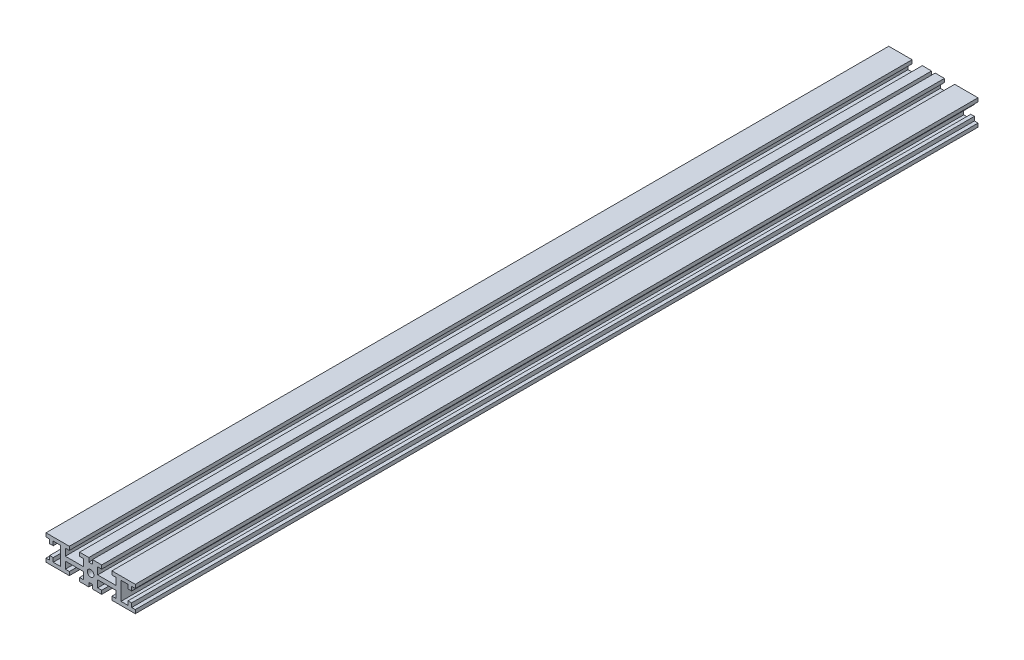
ISO-10303-21;
HEADER;
FILE_DESCRIPTION(('STEP AP214'),'2;1');
FILE_NAME('part.step','',(''),(''),'','','');
FILE_SCHEMA(('AUTOMOTIVE_DESIGN { 1 0 10303 214 1 1 1 1 }'));
ENDSEC;
DATA;
#1=APPLICATION_CONTEXT('core data for automotive mechanical design processes');
#2=APPLICATION_PROTOCOL_DEFINITION('international standard','automotive_design',2000,#1);
#3=PRODUCT_CONTEXT('',#1,'mechanical');
#4=PRODUCT('Part','Part','',(#3));
#5=PRODUCT_RELATED_PRODUCT_CATEGORY('part','',(#4));
#6=PRODUCT_DEFINITION_FORMATION('','',#4);
#7=PRODUCT_DEFINITION_CONTEXT('part definition',#1,'design');
#8=PRODUCT_DEFINITION('design','',#6,#7);
#9=PRODUCT_DEFINITION_SHAPE('','',#8);
#10=(LENGTH_UNIT() NAMED_UNIT(*) SI_UNIT(.MILLI.,.METRE.));
#11=(NAMED_UNIT(*) PLANE_ANGLE_UNIT() SI_UNIT($,.RADIAN.));
#12=(NAMED_UNIT(*) SI_UNIT($,.STERADIAN.) SOLID_ANGLE_UNIT());
#13=UNCERTAINTY_MEASURE_WITH_UNIT(LENGTH_MEASURE(1.E-05),#10,'distance_accuracy_value','');
#14=(GEOMETRIC_REPRESENTATION_CONTEXT(3) GLOBAL_UNCERTAINTY_ASSIGNED_CONTEXT((#13)) GLOBAL_UNIT_ASSIGNED_CONTEXT((#10,
#11,#12)) REPRESENTATION_CONTEXT('',''));
#15=CARTESIAN_POINT('',(0.,0.,0.));
#16=DIRECTION('',(0.,0.,1.));
#17=DIRECTION('',(1.,0.,0.));
#18=AXIS2_PLACEMENT_3D('',#15,#16,#17);
#19=CARTESIAN_POINT('',(5.5,6.35,419.6));
#20=DIRECTION('',(0.,-1.,0.));
#21=DIRECTION('',(0.,0.,-1.));
#22=AXIS2_PLACEMENT_3D('',#19,#20,#21);
#23=PLANE('',#22);
#24=DIRECTION('',(-1.,0.,0.));
#25=VECTOR('',#24,1.);
#26=CARTESIAN_POINT('',(5.5,6.35,0.));
#27=LINE('',#26,#25);
#28=CARTESIAN_POINT('',(5.5,6.35,0.));
#29=VERTEX_POINT('',#28);
#30=CARTESIAN_POINT('',(0.9,6.35,0.));
#31=VERTEX_POINT('',#30);
#32=EDGE_CURVE('E479',#29,#31,#27,.T.);
#33=ORIENTED_EDGE('',*,*,#32,.T.);
#34=DIRECTION('',(0.,0.,1.));
#35=VECTOR('',#34,1.);
#36=CARTESIAN_POINT('',(0.9,6.35,0.));
#37=LINE('',#36,#35);
#38=CARTESIAN_POINT('',(0.9,6.35,419.6));
#39=VERTEX_POINT('',#38);
#40=EDGE_CURVE('E460',#31,#39,#37,.T.);
#41=ORIENTED_EDGE('',*,*,#40,.T.);
#42=DIRECTION('',(-1.,0.,0.));
#43=VECTOR('',#42,1.);
#44=CARTESIAN_POINT('',(5.5,6.35,419.6));
#45=LINE('',#44,#43);
#46=CARTESIAN_POINT('',(5.5,6.35,419.6));
#47=VERTEX_POINT('',#46);
#48=EDGE_CURVE('E821',#47,#39,#45,.T.);
#49=ORIENTED_EDGE('',*,*,#48,.F.);
#50=DIRECTION('',(0.,0.,-1.));
#51=VECTOR('',#50,1.);
#52=CARTESIAN_POINT('',(5.5,6.35,419.6));
#53=LINE('',#52,#51);
#54=EDGE_CURVE('E485',#47,#29,#53,.T.);
#55=ORIENTED_EDGE('',*,*,#54,.T.);
#56=EDGE_LOOP('',(#33,#41,#49,#55));
#57=FACE_BOUND('',#56,.T.);
#58=ADVANCED_FACE('F35',(#57),#23,.F.);
#59=CARTESIAN_POINT('',(-5.5,-6.35,419.6));
#60=DIRECTION('',(0.,1.,0.));
#61=DIRECTION('',(-1.,0.,0.));
#62=AXIS2_PLACEMENT_3D('',#59,#60,#61);
#63=PLANE('',#62);
#64=DIRECTION('',(1.,0.,0.));
#65=VECTOR('',#64,1.);
#66=CARTESIAN_POINT('',(-5.5,-6.35,0.));
#67=LINE('',#66,#65);
#68=CARTESIAN_POINT('',(-5.5,-6.35,0.));
#69=VERTEX_POINT('',#68);
#70=CARTESIAN_POINT('',(-0.899999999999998,-6.35,0.));
#71=VERTEX_POINT('',#70);
#72=EDGE_CURVE('E737',#69,#71,#67,.T.);
#73=ORIENTED_EDGE('',*,*,#72,.T.);
#74=DIRECTION('',(0.,0.,1.));
#75=VECTOR('',#74,1.);
#76=CARTESIAN_POINT('',(-0.899999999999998,-6.35,0.));
#77=LINE('',#76,#75);
#78=CARTESIAN_POINT('',(-0.899999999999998,-6.35,419.6));
#79=VERTEX_POINT('',#78);
#80=EDGE_CURVE('E1083',#71,#79,#77,.T.);
#81=ORIENTED_EDGE('',*,*,#80,.T.);
#82=DIRECTION('',(1.,0.,0.));
#83=VECTOR('',#82,1.);
#84=CARTESIAN_POINT('',(-5.5,-6.35,419.6));
#85=LINE('',#84,#83);
#86=CARTESIAN_POINT('',(-5.5,-6.35,419.6));
#87=VERTEX_POINT('',#86);
#88=EDGE_CURVE('E892',#87,#79,#85,.T.);
#89=ORIENTED_EDGE('',*,*,#88,.F.);
#90=DIRECTION('',(0.,0.,-1.));
#91=VECTOR('',#90,1.);
#92=CARTESIAN_POINT('',(-5.5,-6.35,419.6));
#93=LINE('',#92,#91);
#94=EDGE_CURVE('E680',#87,#69,#93,.T.);
#95=ORIENTED_EDGE('',*,*,#94,.T.);
#96=EDGE_LOOP('',(#73,#81,#89,#95));
#97=FACE_BOUND('',#96,.T.);
#98=ADVANCED_FACE('F1142',(#97),#63,.F.);
#99=CARTESIAN_POINT('',(0.,0.,0.));
#100=DIRECTION('',(0.,0.,-1.));
#101=DIRECTION('',(-1.,0.,0.));
#102=AXIS2_PLACEMENT_3D('',#99,#100,#101);
#103=PLANE('',#102);
#104=DIRECTION('',(0.,1.,0.));
#105=VECTOR('',#104,1.);
#106=CARTESIAN_POINT('',(0.9,6.35,0.));
#107=LINE('',#106,#105);
#108=CARTESIAN_POINT('',(0.9,4.35,0.));
#109=VERTEX_POINT('',#108);
#110=EDGE_CURVE('E463',#109,#31,#107,.T.);
#111=ORIENTED_EDGE('',*,*,#110,.T.);
#112=ORIENTED_EDGE('',*,*,#32,.F.);
#113=DIRECTION('',(0.,1.,0.));
#114=VECTOR('',#113,1.);
#115=CARTESIAN_POINT('',(5.5,4.54999999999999,0.));
#116=LINE('',#115,#114);
#117=CARTESIAN_POINT('',(5.5,4.54999999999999,0.));
#118=VERTEX_POINT('',#117);
#119=EDGE_CURVE('E491',#118,#29,#116,.T.);
#120=ORIENTED_EDGE('',*,*,#119,.F.);
#121=DIRECTION('',(1.,0.,0.));
#122=VECTOR('',#121,1.);
#123=CARTESIAN_POINT('',(3.5,4.54999999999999,0.));
#124=LINE('',#123,#122);
#125=CARTESIAN_POINT('',(3.5,4.54999999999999,0.));
#126=VERTEX_POINT('',#125);
#127=EDGE_CURVE('E793',#126,#118,#124,.T.);
#128=ORIENTED_EDGE('',*,*,#127,.F.);
#129=DIRECTION('',(0.,1.,0.));
#130=VECTOR('',#129,1.);
#131=CARTESIAN_POINT('',(3.5,4.54999999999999,0.));
#132=LINE('',#131,#130);
#133=CARTESIAN_POINT('',(3.5,1.04999999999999,0.));
#134=VERTEX_POINT('',#133);
#135=EDGE_CURVE('E792',#134,#126,#132,.T.);
#136=ORIENTED_EDGE('',*,*,#135,.F.);
#137=DIRECTION('',(-1.,0.,0.));
#138=VECTOR('',#137,1.);
#139=CARTESIAN_POINT('',(3.5,1.04999999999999,0.));
#140=LINE('',#139,#138);
#141=CARTESIAN_POINT('',(12.6,1.04999999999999,0.));
#142=VERTEX_POINT('',#141);
#143=EDGE_CURVE('E790',#142,#134,#140,.T.);
#144=ORIENTED_EDGE('',*,*,#143,.F.);
#145=DIRECTION('',(0.,-1.,0.));
#146=VECTOR('',#145,1.);
#147=CARTESIAN_POINT('',(12.6,1.04999999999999,0.));
#148=LINE('',#147,#146);
#149=CARTESIAN_POINT('',(12.6,4.55,0.));
#150=VERTEX_POINT('',#149);
#151=EDGE_CURVE('E788',#150,#142,#148,.T.);
#152=ORIENTED_EDGE('',*,*,#151,.F.);
#153=DIRECTION('',(1.,0.,0.));
#154=VECTOR('',#153,1.);
#155=CARTESIAN_POINT('',(12.6,4.55,0.));
#156=LINE('',#155,#154);
#157=CARTESIAN_POINT('',(10.6,4.55,0.));
#158=VERTEX_POINT('',#157);
#159=EDGE_CURVE('E786',#158,#150,#156,.T.);
#160=ORIENTED_EDGE('',*,*,#159,.F.);
#161=DIRECTION('',(0.,-1.,0.));
#162=VECTOR('',#161,1.);
#163=CARTESIAN_POINT('',(10.6,4.55,0.));
#164=LINE('',#163,#162);
#165=CARTESIAN_POINT('',(10.6,6.35,0.));
#166=VERTEX_POINT('',#165);
#167=EDGE_CURVE('E784',#166,#158,#164,.T.);
#168=ORIENTED_EDGE('',*,*,#167,.F.);
#169=DIRECTION('',(-1.,0.,0.));
#170=VECTOR('',#169,1.);
#171=CARTESIAN_POINT('',(10.6,6.35,0.));
#172=LINE('',#171,#170);
#173=CARTESIAN_POINT('',(22.225,6.35,0.));
#174=VERTEX_POINT('',#173);
#175=EDGE_CURVE('E782',#174,#166,#172,.T.);
#176=ORIENTED_EDGE('',*,*,#175,.F.);
#177=DIRECTION('',(0.,1.,0.));
#178=VECTOR('',#177,1.);
#179=CARTESIAN_POINT('',(22.225,4.55,0.));
#180=LINE('',#179,#178);
#181=CARTESIAN_POINT('',(22.225,4.55,0.));
#182=VERTEX_POINT('',#181);
#183=EDGE_CURVE('E780',#182,#174,#180,.T.);
#184=ORIENTED_EDGE('',*,*,#183,.F.);
#185=DIRECTION('',(1.,0.,0.));
#186=VECTOR('',#185,1.);
#187=CARTESIAN_POINT('',(20.425,4.55,0.));
#188=LINE('',#187,#186);
#189=CARTESIAN_POINT('',(20.425,4.55,0.));
#190=VERTEX_POINT('',#189);
#191=EDGE_CURVE('E778',#190,#182,#188,.T.);
#192=ORIENTED_EDGE('',*,*,#191,.F.);
#193=DIRECTION('',(0.,1.,0.));
#194=VECTOR('',#193,1.);
#195=CARTESIAN_POINT('',(20.425,2.55,0.));
#196=LINE('',#195,#194);
#197=CARTESIAN_POINT('',(20.425,2.55,0.));
#198=VERTEX_POINT('',#197);
#199=EDGE_CURVE('E776',#198,#190,#196,.T.);
#200=ORIENTED_EDGE('',*,*,#199,.F.);
#201=DIRECTION('',(1.,0.,0.));
#202=VECTOR('',#201,1.);
#203=CARTESIAN_POINT('',(18.625,2.55,0.));
#204=LINE('',#203,#202);
#205=CARTESIAN_POINT('',(18.625,2.55,0.));
#206=VERTEX_POINT('',#205);
#207=EDGE_CURVE('E774',#206,#198,#204,.T.);
#208=ORIENTED_EDGE('',*,*,#207,.F.);
#209=DIRECTION('',(0.,-1.,0.));
#210=VECTOR('',#209,1.);
#211=CARTESIAN_POINT('',(18.625,4.55,0.));
#212=LINE('',#211,#210);
#213=CARTESIAN_POINT('',(18.625,4.55,0.));
#214=VERTEX_POINT('',#213);
#215=EDGE_CURVE('E772',#214,#206,#212,.T.);
#216=ORIENTED_EDGE('',*,*,#215,.F.);
#217=DIRECTION('',(1.,0.,0.));
#218=VECTOR('',#217,1.);
#219=CARTESIAN_POINT('',(15.125,4.55,0.));
#220=LINE('',#219,#218);
#221=CARTESIAN_POINT('',(15.125,4.55,0.));
#222=VERTEX_POINT('',#221);
#223=EDGE_CURVE('E770',#222,#214,#220,.T.);
#224=ORIENTED_EDGE('',*,*,#223,.F.);
#225=DIRECTION('',(0.,1.,0.));
#226=VECTOR('',#225,1.);
#227=CARTESIAN_POINT('',(15.125,4.55,0.));
#228=LINE('',#227,#226);
#229=CARTESIAN_POINT('',(15.125,-4.55,0.));
#230=VERTEX_POINT('',#229);
#231=EDGE_CURVE('E768',#230,#222,#228,.T.);
#232=ORIENTED_EDGE('',*,*,#231,.F.);
#233=DIRECTION('',(-1.,0.,0.));
#234=VECTOR('',#233,1.);
#235=CARTESIAN_POINT('',(18.625,-4.55,0.));
#236=LINE('',#235,#234);
#237=CARTESIAN_POINT('',(18.625,-4.55,0.));
#238=VERTEX_POINT('',#237);
#239=EDGE_CURVE('E766',#238,#230,#236,.T.);
#240=ORIENTED_EDGE('',*,*,#239,.F.);
#241=DIRECTION('',(0.,-1.,0.));
#242=VECTOR('',#241,1.);
#243=CARTESIAN_POINT('',(18.625,-4.55,0.));
#244=LINE('',#243,#242);
#245=CARTESIAN_POINT('',(18.625,-2.55,0.));
#246=VERTEX_POINT('',#245);
#247=EDGE_CURVE('E764',#246,#238,#244,.T.);
#248=ORIENTED_EDGE('',*,*,#247,.F.);
#249=DIRECTION('',(-1.,0.,0.));
#250=VECTOR('',#249,1.);
#251=CARTESIAN_POINT('',(18.625,-2.55,0.));
#252=LINE('',#251,#250);
#253=CARTESIAN_POINT('',(20.425,-2.55,0.));
#254=VERTEX_POINT('',#253);
#255=EDGE_CURVE('E762',#254,#246,#252,.T.);
#256=ORIENTED_EDGE('',*,*,#255,.F.);
#257=DIRECTION('',(0.,1.,0.));
#258=VECTOR('',#257,1.);
#259=CARTESIAN_POINT('',(20.425,-2.55,0.));
#260=LINE('',#259,#258);
#261=CARTESIAN_POINT('',(20.425,-4.55,0.));
#262=VERTEX_POINT('',#261);
#263=EDGE_CURVE('E760',#262,#254,#260,.T.);
#264=ORIENTED_EDGE('',*,*,#263,.F.);
#265=DIRECTION('',(-1.,0.,0.));
#266=VECTOR('',#265,1.);
#267=CARTESIAN_POINT('',(20.425,-4.55,0.));
#268=LINE('',#267,#266);
#269=CARTESIAN_POINT('',(22.225,-4.55,0.));
#270=VERTEX_POINT('',#269);
#271=EDGE_CURVE('E758',#270,#262,#268,.T.);
#272=ORIENTED_EDGE('',*,*,#271,.F.);
#273=DIRECTION('',(0.,1.,0.));
#274=VECTOR('',#273,1.);
#275=CARTESIAN_POINT('',(22.225,-4.55,0.));
#276=LINE('',#275,#274);
#277=CARTESIAN_POINT('',(22.225,-6.35,0.));
#278=VERTEX_POINT('',#277);
#279=EDGE_CURVE('E756',#278,#270,#276,.T.);
#280=ORIENTED_EDGE('',*,*,#279,.F.);
#281=DIRECTION('',(1.,0.,0.));
#282=VECTOR('',#281,1.);
#283=CARTESIAN_POINT('',(22.225,-6.35,0.));
#284=LINE('',#283,#282);
#285=CARTESIAN_POINT('',(10.6,-6.35,0.));
#286=VERTEX_POINT('',#285);
#287=EDGE_CURVE('E754',#286,#278,#284,.T.);
#288=ORIENTED_EDGE('',*,*,#287,.F.);
#289=DIRECTION('',(0.,-1.,0.));
#290=VECTOR('',#289,1.);
#291=CARTESIAN_POINT('',(10.6,-4.55,0.));
#292=LINE('',#291,#290);
#293=CARTESIAN_POINT('',(10.6,-4.55,0.));
#294=VERTEX_POINT('',#293);
#295=EDGE_CURVE('E752',#294,#286,#292,.T.);
#296=ORIENTED_EDGE('',*,*,#295,.F.);
#297=DIRECTION('',(-1.,0.,0.));
#298=VECTOR('',#297,1.);
#299=CARTESIAN_POINT('',(12.6,-4.55,0.));
#300=LINE('',#299,#298);
#301=CARTESIAN_POINT('',(12.6,-4.55,0.));
#302=VERTEX_POINT('',#301);
#303=EDGE_CURVE('E750',#302,#294,#300,.T.);
#304=ORIENTED_EDGE('',*,*,#303,.F.);
#305=DIRECTION('',(0.,-1.,0.));
#306=VECTOR('',#305,1.);
#307=CARTESIAN_POINT('',(12.6,-1.05,0.));
#308=LINE('',#307,#306);
#309=CARTESIAN_POINT('',(12.6,-1.05,0.));
#310=VERTEX_POINT('',#309);
#311=EDGE_CURVE('E748',#310,#302,#308,.T.);
#312=ORIENTED_EDGE('',*,*,#311,.F.);
#313=DIRECTION('',(1.,0.,0.));
#314=VECTOR('',#313,1.);
#315=CARTESIAN_POINT('',(3.5,-1.05,0.));
#316=LINE('',#315,#314);
#317=CARTESIAN_POINT('',(3.5,-1.05,0.));
#318=VERTEX_POINT('',#317);
#319=EDGE_CURVE('E746',#318,#310,#316,.T.);
#320=ORIENTED_EDGE('',*,*,#319,.F.);
#321=DIRECTION('',(0.,1.,0.));
#322=VECTOR('',#321,1.);
#323=CARTESIAN_POINT('',(3.5,-4.55,0.));
#324=LINE('',#323,#322);
#325=CARTESIAN_POINT('',(3.5,-4.55,0.));
#326=VERTEX_POINT('',#325);
#327=EDGE_CURVE('E744',#326,#318,#324,.T.);
#328=ORIENTED_EDGE('',*,*,#327,.F.);
#329=DIRECTION('',(-1.,0.,0.));
#330=VECTOR('',#329,1.);
#331=CARTESIAN_POINT('',(5.5,-4.55,0.));
#332=LINE('',#331,#330);
#333=CARTESIAN_POINT('',(5.5,-4.55,0.));
#334=VERTEX_POINT('',#333);
#335=EDGE_CURVE('E742',#334,#326,#332,.T.);
#336=ORIENTED_EDGE('',*,*,#335,.F.);
#337=DIRECTION('',(0.,1.,0.));
#338=VECTOR('',#337,1.);
#339=CARTESIAN_POINT('',(5.5,-4.55,0.));
#340=LINE('',#339,#338);
#341=CARTESIAN_POINT('',(5.5,-6.35,0.));
#342=VERTEX_POINT('',#341);
#343=EDGE_CURVE('E740',#342,#334,#340,.T.);
#344=ORIENTED_EDGE('',*,*,#343,.F.);
#345=CARTESIAN_POINT('',(0.900000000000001,-6.35,0.));
#346=VERTEX_POINT('',#345);
#347=EDGE_CURVE('E736',#346,#342,#67,.T.);
#348=ORIENTED_EDGE('',*,*,#347,.F.);
#349=DIRECTION('',(0.,1.,0.));
#350=VECTOR('',#349,1.);
#351=CARTESIAN_POINT('',(0.900000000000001,-6.35,0.));
#352=LINE('',#351,#350);
#353=CARTESIAN_POINT('',(0.900000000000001,-4.35,0.));
#354=VERTEX_POINT('',#353);
#355=EDGE_CURVE('E58',#346,#354,#352,.T.);
#356=ORIENTED_EDGE('',*,*,#355,.T.);
#357=DIRECTION('',(-1.,0.,0.));
#358=VECTOR('',#357,1.);
#359=CARTESIAN_POINT('',(-0.899999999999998,-4.35,0.));
#360=LINE('',#359,#358);
#361=CARTESIAN_POINT('',(-0.899999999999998,-4.35,0.));
#362=VERTEX_POINT('',#361);
#363=EDGE_CURVE('E1087',#354,#362,#360,.T.);
#364=ORIENTED_EDGE('',*,*,#363,.T.);
#365=DIRECTION('',(0.,-1.,0.));
#366=VECTOR('',#365,1.);
#367=CARTESIAN_POINT('',(-0.899999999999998,-6.35,0.));
#368=LINE('',#367,#366);
#369=EDGE_CURVE('E1093',#362,#71,#368,.T.);
#370=ORIENTED_EDGE('',*,*,#369,.T.);
#371=ORIENTED_EDGE('',*,*,#72,.F.);
#372=DIRECTION('',(0.,-1.,0.));
#373=VECTOR('',#372,1.);
#374=CARTESIAN_POINT('',(-5.5,-4.55,0.));
#375=LINE('',#374,#373);
#376=CARTESIAN_POINT('',(-5.5,-4.55,0.));
#377=VERTEX_POINT('',#376);
#378=EDGE_CURVE('E734',#377,#69,#375,.T.);
#379=ORIENTED_EDGE('',*,*,#378,.F.);
#380=DIRECTION('',(-1.,0.,0.));
#381=VECTOR('',#380,1.);
#382=CARTESIAN_POINT('',(-5.5,-4.55,0.));
#383=LINE('',#382,#381);
#384=CARTESIAN_POINT('',(-3.5,-4.55,0.));
#385=VERTEX_POINT('',#384);
#386=EDGE_CURVE('E732',#385,#377,#383,.T.);
#387=ORIENTED_EDGE('',*,*,#386,.F.);
#388=DIRECTION('',(0.,-1.,0.));
#389=VECTOR('',#388,1.);
#390=CARTESIAN_POINT('',(-3.5,-4.55,0.));
#391=LINE('',#390,#389);
#392=CARTESIAN_POINT('',(-3.5,-1.05,0.));
#393=VERTEX_POINT('',#392);
#394=EDGE_CURVE('E730',#393,#385,#391,.T.);
#395=ORIENTED_EDGE('',*,*,#394,.F.);
#396=DIRECTION('',(1.,0.,0.));
#397=VECTOR('',#396,1.);
#398=CARTESIAN_POINT('',(-3.5,-1.05,0.));
#399=LINE('',#398,#397);
#400=CARTESIAN_POINT('',(-12.6,-1.05,0.));
#401=VERTEX_POINT('',#400);
#402=EDGE_CURVE('E728',#401,#393,#399,.T.);
#403=ORIENTED_EDGE('',*,*,#402,.F.);
#404=DIRECTION('',(0.,1.,0.));
#405=VECTOR('',#404,1.);
#406=CARTESIAN_POINT('',(-12.6,-1.05,0.));
#407=LINE('',#406,#405);
#408=CARTESIAN_POINT('',(-12.6,-4.55,0.));
#409=VERTEX_POINT('',#408);
#410=EDGE_CURVE('E726',#409,#401,#407,.T.);
#411=ORIENTED_EDGE('',*,*,#410,.F.);
#412=DIRECTION('',(-1.,0.,0.));
#413=VECTOR('',#412,1.);
#414=CARTESIAN_POINT('',(-12.6,-4.55,0.));
#415=LINE('',#414,#413);
#416=CARTESIAN_POINT('',(-10.6,-4.55,0.));
#417=VERTEX_POINT('',#416);
#418=EDGE_CURVE('E719',#417,#409,#415,.T.);
#419=ORIENTED_EDGE('',*,*,#418,.F.);
#420=DIRECTION('',(0.,1.,0.));
#421=VECTOR('',#420,1.);
#422=CARTESIAN_POINT('',(-10.6,-4.55,0.));
#423=LINE('',#422,#421);
#424=CARTESIAN_POINT('',(-10.6,-6.35,0.));
#425=VERTEX_POINT('',#424);
#426=EDGE_CURVE('E717',#425,#417,#423,.T.);
#427=ORIENTED_EDGE('',*,*,#426,.F.);
#428=DIRECTION('',(1.,0.,0.));
#429=VECTOR('',#428,1.);
#430=CARTESIAN_POINT('',(-22.225,-6.35,0.));
#431=LINE('',#430,#429);
#432=CARTESIAN_POINT('',(-22.225,-6.35,0.));
#433=VERTEX_POINT('',#432);
#434=EDGE_CURVE('E710',#433,#425,#431,.T.);
#435=ORIENTED_EDGE('',*,*,#434,.F.);
#436=DIRECTION('',(0.,-1.,0.));
#437=VECTOR('',#436,1.);
#438=CARTESIAN_POINT('',(-22.225,-6.35,0.));
#439=LINE('',#438,#437);
#440=CARTESIAN_POINT('',(-22.225,-4.55,0.));
#441=VERTEX_POINT('',#440);
#442=EDGE_CURVE('E715',#441,#433,#439,.T.);
#443=ORIENTED_EDGE('',*,*,#442,.F.);
#444=DIRECTION('',(-1.,0.,0.));
#445=VECTOR('',#444,1.);
#446=CARTESIAN_POINT('',(-20.425,-4.55,0.));
#447=LINE('',#446,#445);
#448=CARTESIAN_POINT('',(-20.425,-4.55,0.));
#449=VERTEX_POINT('',#448);
#450=EDGE_CURVE('E721',#449,#441,#447,.T.);
#451=ORIENTED_EDGE('',*,*,#450,.F.);
#452=DIRECTION('',(0.,-1.,0.));
#453=VECTOR('',#452,1.);
#454=CARTESIAN_POINT('',(-20.425,-2.55,0.));
#455=LINE('',#454,#453);
#456=CARTESIAN_POINT('',(-20.425,-2.55,0.));
#457=VERTEX_POINT('',#456);
#458=EDGE_CURVE('E528',#457,#449,#455,.T.);
#459=ORIENTED_EDGE('',*,*,#458,.F.);
#460=DIRECTION('',(-1.,0.,0.));
#461=VECTOR('',#460,1.);
#462=CARTESIAN_POINT('',(-18.625,-2.55,0.));
#463=LINE('',#462,#461);
#464=CARTESIAN_POINT('',(-18.625,-2.55,0.));
#465=VERTEX_POINT('',#464);
#466=EDGE_CURVE('E526',#465,#457,#463,.T.);
#467=ORIENTED_EDGE('',*,*,#466,.F.);
#468=DIRECTION('',(0.,1.,0.));
#469=VECTOR('',#468,1.);
#470=CARTESIAN_POINT('',(-18.625,-4.55,0.));
#471=LINE('',#470,#469);
#472=CARTESIAN_POINT('',(-18.625,-4.55,0.));
#473=VERTEX_POINT('',#472);
#474=EDGE_CURVE('E524',#473,#465,#471,.T.);
#475=ORIENTED_EDGE('',*,*,#474,.F.);
#476=DIRECTION('',(-1.,0.,0.));
#477=VECTOR('',#476,1.);
#478=CARTESIAN_POINT('',(-18.625,-4.55,0.));
#479=LINE('',#478,#477);
#480=CARTESIAN_POINT('',(-15.125,-4.55,0.));
#481=VERTEX_POINT('',#480);
#482=EDGE_CURVE('E522',#481,#473,#479,.T.);
#483=ORIENTED_EDGE('',*,*,#482,.F.);
#484=DIRECTION('',(0.,-1.,0.));
#485=VECTOR('',#484,1.);
#486=CARTESIAN_POINT('',(-15.125,4.55,0.));
#487=LINE('',#486,#485);
#488=CARTESIAN_POINT('',(-15.125,4.55,0.));
#489=VERTEX_POINT('',#488);
#490=EDGE_CURVE('E520',#489,#481,#487,.T.);
#491=ORIENTED_EDGE('',*,*,#490,.F.);
#492=DIRECTION('',(1.,0.,0.));
#493=VECTOR('',#492,1.);
#494=CARTESIAN_POINT('',(-15.125,4.55,0.));
#495=LINE('',#494,#493);
#496=CARTESIAN_POINT('',(-18.625,4.55,0.));
#497=VERTEX_POINT('',#496);
#498=EDGE_CURVE('E518',#497,#489,#495,.T.);
#499=ORIENTED_EDGE('',*,*,#498,.F.);
#500=DIRECTION('',(0.,1.,0.));
#501=VECTOR('',#500,1.);
#502=CARTESIAN_POINT('',(-18.625,4.55,0.));
#503=LINE('',#502,#501);
#504=CARTESIAN_POINT('',(-18.625,2.55,0.));
#505=VERTEX_POINT('',#504);
#506=EDGE_CURVE('E516',#505,#497,#503,.T.);
#507=ORIENTED_EDGE('',*,*,#506,.F.);
#508=DIRECTION('',(1.,0.,0.));
#509=VECTOR('',#508,1.);
#510=CARTESIAN_POINT('',(-18.625,2.55,0.));
#511=LINE('',#510,#509);
#512=CARTESIAN_POINT('',(-20.425,2.55,0.));
#513=VERTEX_POINT('',#512);
#514=EDGE_CURVE('E514',#513,#505,#511,.T.);
#515=ORIENTED_EDGE('',*,*,#514,.F.);
#516=DIRECTION('',(0.,-1.,0.));
#517=VECTOR('',#516,1.);
#518=CARTESIAN_POINT('',(-20.425,2.55,0.));
#519=LINE('',#518,#517);
#520=CARTESIAN_POINT('',(-20.425,4.55,0.));
#521=VERTEX_POINT('',#520);
#522=EDGE_CURVE('E512',#521,#513,#519,.T.);
#523=ORIENTED_EDGE('',*,*,#522,.F.);
#524=DIRECTION('',(1.,0.,0.));
#525=VECTOR('',#524,1.);
#526=CARTESIAN_POINT('',(-20.425,4.55,0.));
#527=LINE('',#526,#525);
#528=CARTESIAN_POINT('',(-22.225,4.55,0.));
#529=VERTEX_POINT('',#528);
#530=EDGE_CURVE('E510',#529,#521,#527,.T.);
#531=ORIENTED_EDGE('',*,*,#530,.F.);
#532=DIRECTION('',(0.,-1.,0.));
#533=VECTOR('',#532,1.);
#534=CARTESIAN_POINT('',(-22.225,6.35,0.));
#535=LINE('',#534,#533);
#536=CARTESIAN_POINT('',(-22.225,6.35,0.));
#537=VERTEX_POINT('',#536);
#538=EDGE_CURVE('E508',#537,#529,#535,.T.);
#539=ORIENTED_EDGE('',*,*,#538,.F.);
#540=DIRECTION('',(-1.,0.,0.));
#541=VECTOR('',#540,1.);
#542=CARTESIAN_POINT('',(-10.6,6.35,0.));
#543=LINE('',#542,#541);
#544=CARTESIAN_POINT('',(-10.6,6.35,0.));
#545=VERTEX_POINT('',#544);
#546=EDGE_CURVE('E506',#545,#537,#543,.T.);
#547=ORIENTED_EDGE('',*,*,#546,.F.);
#548=DIRECTION('',(0.,1.,0.));
#549=VECTOR('',#548,1.);
#550=CARTESIAN_POINT('',(-10.6,4.55,0.));
#551=LINE('',#550,#549);
#552=CARTESIAN_POINT('',(-10.6,4.55,0.));
#553=VERTEX_POINT('',#552);
#554=EDGE_CURVE('E504',#553,#545,#551,.T.);
#555=ORIENTED_EDGE('',*,*,#554,.F.);
#556=DIRECTION('',(1.,0.,0.));
#557=VECTOR('',#556,1.);
#558=CARTESIAN_POINT('',(-12.6,4.55,0.));
#559=LINE('',#558,#557);
#560=CARTESIAN_POINT('',(-12.6,4.55,0.));
#561=VERTEX_POINT('',#560);
#562=EDGE_CURVE('E502',#561,#553,#559,.T.);
#563=ORIENTED_EDGE('',*,*,#562,.F.);
#564=DIRECTION('',(0.,1.,0.));
#565=VECTOR('',#564,1.);
#566=CARTESIAN_POINT('',(-12.6,1.04999999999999,0.));
#567=LINE('',#566,#565);
#568=CARTESIAN_POINT('',(-12.6,1.04999999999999,0.));
#569=VERTEX_POINT('',#568);
#570=EDGE_CURVE('E500',#569,#561,#567,.T.);
#571=ORIENTED_EDGE('',*,*,#570,.F.);
#572=DIRECTION('',(-1.,0.,0.));
#573=VECTOR('',#572,1.);
#574=CARTESIAN_POINT('',(-3.5,1.04999999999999,0.));
#575=LINE('',#574,#573);
#576=CARTESIAN_POINT('',(-3.5,1.04999999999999,0.));
#577=VERTEX_POINT('',#576);
#578=EDGE_CURVE('E498',#577,#569,#575,.T.);
#579=ORIENTED_EDGE('',*,*,#578,.F.);
#580=DIRECTION('',(0.,-1.,0.));
#581=VECTOR('',#580,1.);
#582=CARTESIAN_POINT('',(-3.5,4.54999999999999,0.));
#583=LINE('',#582,#581);
#584=CARTESIAN_POINT('',(-3.5,4.54999999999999,0.));
#585=VERTEX_POINT('',#584);
#586=EDGE_CURVE('E496',#585,#577,#583,.T.);
#587=ORIENTED_EDGE('',*,*,#586,.F.);
#588=DIRECTION('',(1.,0.,0.));
#589=VECTOR('',#588,1.);
#590=CARTESIAN_POINT('',(-3.5,4.54999999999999,0.));
#591=LINE('',#590,#589);
#592=CARTESIAN_POINT('',(-5.5,4.54999999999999,0.));
#593=VERTEX_POINT('',#592);
#594=EDGE_CURVE('E489',#593,#585,#591,.T.);
#595=ORIENTED_EDGE('',*,*,#594,.F.);
#596=DIRECTION('',(0.,-1.,0.));
#597=VECTOR('',#596,1.);
#598=CARTESIAN_POINT('',(-5.5,4.54999999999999,0.));
#599=LINE('',#598,#597);
#600=CARTESIAN_POINT('',(-5.5,6.35,0.));
#601=VERTEX_POINT('',#600);
#602=EDGE_CURVE('E486',#601,#593,#599,.T.);
#603=ORIENTED_EDGE('',*,*,#602,.F.);
#604=CARTESIAN_POINT('',(-0.900000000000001,6.35,0.));
#605=VERTEX_POINT('',#604);
#606=EDGE_CURVE('E487',#605,#601,#27,.T.);
#607=ORIENTED_EDGE('',*,*,#606,.F.);
#608=DIRECTION('',(0.,-1.,0.));
#609=VECTOR('',#608,1.);
#610=CARTESIAN_POINT('',(-0.9,6.35,0.));
#611=LINE('',#610,#609);
#612=CARTESIAN_POINT('',(-0.9,4.35,0.));
#613=VERTEX_POINT('',#612);
#614=EDGE_CURVE('E50',#605,#613,#611,.T.);
#615=ORIENTED_EDGE('',*,*,#614,.T.);
#616=DIRECTION('',(1.,0.,0.));
#617=VECTOR('',#616,1.);
#618=CARTESIAN_POINT('',(0.9,4.35,0.));
#619=LINE('',#618,#617);
#620=EDGE_CURVE('E472',#613,#109,#619,.T.);
#621=ORIENTED_EDGE('',*,*,#620,.T.);
#622=EDGE_LOOP('',(#111,#112,#120,#128,#136,#144,#152,#160,#168,#176,#184,#192,#200,#208,#216,
#224,#232,#240,#248,#256,#264,#272,#280,#288,#296,#304,#312,#320,#328,#336,#344,#348,#356,#364,
#370,#371,#379,#387,#395,#403,#411,#419,#427,#435,#443,#451,#459,#467,#475,#483,#491,#499,#507,
#515,#523,#531,#539,#547,#555,#563,#571,#579,#587,#595,#603,#607,#615,#621));
#623=FACE_BOUND('',#622,.T.);
#624=CARTESIAN_POINT('',(0.,0.,0.));
#625=DIRECTION('',(0.,0.,1.));
#626=DIRECTION('',(1.,0.,0.));
#627=AXIS2_PLACEMENT_3D('',#624,#625,#626);
#628=CIRCLE('',#627,1.6499999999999);
#629=CARTESIAN_POINT('',(1.6499999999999,0.,0.));
#630=VERTEX_POINT('',#629);
#631=EDGE_CURVE('E860',#630,#630,#628,.T.);
#632=ORIENTED_EDGE('',*,*,#631,.T.);
#633=EDGE_LOOP('',(#632));
#634=FACE_BOUND('',#633,.T.);
#635=ADVANCED_FACE('F476',(#623,#634),#103,.T.);
#636=CARTESIAN_POINT('',(0.,0.,419.6));
#637=DIRECTION('',(0.,0.,-1.));
#638=DIRECTION('',(-1.,0.,0.));
#639=AXIS2_PLACEMENT_3D('',#636,#637,#638);
#640=PLANE('',#639);
#641=ORIENTED_EDGE('',*,*,#48,.T.);
#642=DIRECTION('',(0.,1.,0.));
#643=VECTOR('',#642,1.);
#644=CARTESIAN_POINT('',(0.9,6.35,419.6));
#645=LINE('',#644,#643);
#646=CARTESIAN_POINT('',(0.9,4.35,419.6));
#647=VERTEX_POINT('',#646);
#648=EDGE_CURVE('E466',#647,#39,#645,.T.);
#649=ORIENTED_EDGE('',*,*,#648,.F.);
#650=DIRECTION('',(1.,0.,0.));
#651=VECTOR('',#650,1.);
#652=CARTESIAN_POINT('',(0.9,4.35,419.6));
#653=LINE('',#652,#651);
#654=CARTESIAN_POINT('',(-0.9,4.35,419.6));
#655=VERTEX_POINT('',#654);
#656=EDGE_CURVE('E481',#655,#647,#653,.T.);
#657=ORIENTED_EDGE('',*,*,#656,.F.);
#658=DIRECTION('',(0.,-1.,0.));
#659=VECTOR('',#658,1.);
#660=CARTESIAN_POINT('',(-0.9,6.35,419.6));
#661=LINE('',#660,#659);
#662=CARTESIAN_POINT('',(-0.9,6.35,419.6));
#663=VERTEX_POINT('',#662);
#664=EDGE_CURVE('E1109',#663,#655,#661,.T.);
#665=ORIENTED_EDGE('',*,*,#664,.F.);
#666=CARTESIAN_POINT('',(-5.5,6.35,419.6));
#667=VERTEX_POINT('',#666);
#668=EDGE_CURVE('E815',#663,#667,#45,.T.);
#669=ORIENTED_EDGE('',*,*,#668,.T.);
#670=DIRECTION('',(0.,-1.,0.));
#671=VECTOR('',#670,1.);
#672=CARTESIAN_POINT('',(-5.5,4.54999999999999,419.6));
#673=LINE('',#672,#671);
#674=CARTESIAN_POINT('',(-5.5,4.54999999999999,419.6));
#675=VERTEX_POINT('',#674);
#676=EDGE_CURVE('E823',#667,#675,#673,.T.);
#677=ORIENTED_EDGE('',*,*,#676,.T.);
#678=DIRECTION('',(1.,0.,0.));
#679=VECTOR('',#678,1.);
#680=CARTESIAN_POINT('',(-3.5,4.54999999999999,419.6));
#681=LINE('',#680,#679);
#682=CARTESIAN_POINT('',(-3.5,4.54999999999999,419.6));
#683=VERTEX_POINT('',#682);
#684=EDGE_CURVE('E825',#675,#683,#681,.T.);
#685=ORIENTED_EDGE('',*,*,#684,.T.);
#686=DIRECTION('',(0.,-1.,0.));
#687=VECTOR('',#686,1.);
#688=CARTESIAN_POINT('',(-3.5,4.54999999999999,419.6));
#689=LINE('',#688,#687);
#690=CARTESIAN_POINT('',(-3.5,1.04999999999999,419.6));
#691=VERTEX_POINT('',#690);
#692=EDGE_CURVE('E827',#683,#691,#689,.T.);
#693=ORIENTED_EDGE('',*,*,#692,.T.);
#694=DIRECTION('',(-1.,0.,0.));
#695=VECTOR('',#694,1.);
#696=CARTESIAN_POINT('',(-3.5,1.04999999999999,419.6));
#697=LINE('',#696,#695);
#698=CARTESIAN_POINT('',(-12.6,1.04999999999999,419.6));
#699=VERTEX_POINT('',#698);
#700=EDGE_CURVE('E829',#691,#699,#697,.T.);
#701=ORIENTED_EDGE('',*,*,#700,.T.);
#702=DIRECTION('',(0.,1.,0.));
#703=VECTOR('',#702,1.);
#704=CARTESIAN_POINT('',(-12.6,1.04999999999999,419.6));
#705=LINE('',#704,#703);
#706=CARTESIAN_POINT('',(-12.6,4.55,419.6));
#707=VERTEX_POINT('',#706);
#708=EDGE_CURVE('E831',#699,#707,#705,.T.);
#709=ORIENTED_EDGE('',*,*,#708,.T.);
#710=DIRECTION('',(1.,0.,0.));
#711=VECTOR('',#710,1.);
#712=CARTESIAN_POINT('',(-12.6,4.55,419.6));
#713=LINE('',#712,#711);
#714=CARTESIAN_POINT('',(-10.6,4.55,419.6));
#715=VERTEX_POINT('',#714);
#716=EDGE_CURVE('E833',#707,#715,#713,.T.);
#717=ORIENTED_EDGE('',*,*,#716,.T.);
#718=DIRECTION('',(0.,1.,0.));
#719=VECTOR('',#718,1.);
#720=CARTESIAN_POINT('',(-10.6,4.55,419.6));
#721=LINE('',#720,#719);
#722=CARTESIAN_POINT('',(-10.6,6.35,419.6));
#723=VERTEX_POINT('',#722);
#724=EDGE_CURVE('E835',#715,#723,#721,.T.);
#725=ORIENTED_EDGE('',*,*,#724,.T.);
#726=DIRECTION('',(-1.,0.,0.));
#727=VECTOR('',#726,1.);
#728=CARTESIAN_POINT('',(-10.6,6.35,419.6));
#729=LINE('',#728,#727);
#730=CARTESIAN_POINT('',(-22.225,6.35,419.6));
#731=VERTEX_POINT('',#730);
#732=EDGE_CURVE('E837',#723,#731,#729,.T.);
#733=ORIENTED_EDGE('',*,*,#732,.T.);
#734=DIRECTION('',(0.,-1.,0.));
#735=VECTOR('',#734,1.);
#736=CARTESIAN_POINT('',(-22.225,6.35,419.6));
#737=LINE('',#736,#735);
#738=CARTESIAN_POINT('',(-22.225,4.55,419.6));
#739=VERTEX_POINT('',#738);
#740=EDGE_CURVE('E839',#731,#739,#737,.T.);
#741=ORIENTED_EDGE('',*,*,#740,.T.);
#742=DIRECTION('',(1.,0.,0.));
#743=VECTOR('',#742,1.);
#744=CARTESIAN_POINT('',(-20.425,4.55,419.6));
#745=LINE('',#744,#743);
#746=CARTESIAN_POINT('',(-20.425,4.55,419.6));
#747=VERTEX_POINT('',#746);
#748=EDGE_CURVE('E841',#739,#747,#745,.T.);
#749=ORIENTED_EDGE('',*,*,#748,.T.);
#750=DIRECTION('',(0.,-1.,0.));
#751=VECTOR('',#750,1.);
#752=CARTESIAN_POINT('',(-20.425,2.55,419.6));
#753=LINE('',#752,#751);
#754=CARTESIAN_POINT('',(-20.425,2.55,419.6));
#755=VERTEX_POINT('',#754);
#756=EDGE_CURVE('E843',#747,#755,#753,.T.);
#757=ORIENTED_EDGE('',*,*,#756,.T.);
#758=DIRECTION('',(1.,0.,0.));
#759=VECTOR('',#758,1.);
#760=CARTESIAN_POINT('',(-18.625,2.55,419.6));
#761=LINE('',#760,#759);
#762=CARTESIAN_POINT('',(-18.625,2.55,419.6));
#763=VERTEX_POINT('',#762);
#764=EDGE_CURVE('E845',#755,#763,#761,.T.);
#765=ORIENTED_EDGE('',*,*,#764,.T.);
#766=DIRECTION('',(0.,1.,0.));
#767=VECTOR('',#766,1.);
#768=CARTESIAN_POINT('',(-18.625,4.55,419.6));
#769=LINE('',#768,#767);
#770=CARTESIAN_POINT('',(-18.625,4.55,419.6));
#771=VERTEX_POINT('',#770);
#772=EDGE_CURVE('E847',#763,#771,#769,.T.);
#773=ORIENTED_EDGE('',*,*,#772,.T.);
#774=DIRECTION('',(1.,0.,0.));
#775=VECTOR('',#774,1.);
#776=CARTESIAN_POINT('',(-15.125,4.55,419.6));
#777=LINE('',#776,#775);
#778=CARTESIAN_POINT('',(-15.125,4.55,419.6));
#779=VERTEX_POINT('',#778);
#780=EDGE_CURVE('E849',#771,#779,#777,.T.);
#781=ORIENTED_EDGE('',*,*,#780,.T.);
#782=DIRECTION('',(0.,-1.,0.));
#783=VECTOR('',#782,1.);
#784=CARTESIAN_POINT('',(-15.125,4.55,419.6));
#785=LINE('',#784,#783);
#786=CARTESIAN_POINT('',(-15.125,-4.55,419.6));
#787=VERTEX_POINT('',#786);
#788=EDGE_CURVE('E851',#779,#787,#785,.T.);
#789=ORIENTED_EDGE('',*,*,#788,.T.);
#790=DIRECTION('',(-1.,0.,0.));
#791=VECTOR('',#790,1.);
#792=CARTESIAN_POINT('',(-18.625,-4.55,419.6));
#793=LINE('',#792,#791);
#794=CARTESIAN_POINT('',(-18.625,-4.55,419.6));
#795=VERTEX_POINT('',#794);
#796=EDGE_CURVE('E853',#787,#795,#793,.T.);
#797=ORIENTED_EDGE('',*,*,#796,.T.);
#798=DIRECTION('',(0.,1.,0.));
#799=VECTOR('',#798,1.);
#800=CARTESIAN_POINT('',(-18.625,-4.55,419.6));
#801=LINE('',#800,#799);
#802=CARTESIAN_POINT('',(-18.625,-2.55,419.6));
#803=VERTEX_POINT('',#802);
#804=EDGE_CURVE('E855',#795,#803,#801,.T.);
#805=ORIENTED_EDGE('',*,*,#804,.T.);
#806=DIRECTION('',(-1.,0.,0.));
#807=VECTOR('',#806,1.);
#808=CARTESIAN_POINT('',(-18.625,-2.55,419.6));
#809=LINE('',#808,#807);
#810=CARTESIAN_POINT('',(-20.425,-2.55,419.6));
#811=VERTEX_POINT('',#810);
#812=EDGE_CURVE('E857',#803,#811,#809,.T.);
#813=ORIENTED_EDGE('',*,*,#812,.T.);
#814=DIRECTION('',(0.,-1.,0.));
#815=VECTOR('',#814,1.);
#816=CARTESIAN_POINT('',(-20.425,-2.55,419.6));
#817=LINE('',#816,#815);
#818=CARTESIAN_POINT('',(-20.425,-4.55,419.6));
#819=VERTEX_POINT('',#818);
#820=EDGE_CURVE('E535',#811,#819,#817,.T.);
#821=ORIENTED_EDGE('',*,*,#820,.T.);
#822=DIRECTION('',(-1.,0.,0.));
#823=VECTOR('',#822,1.);
#824=CARTESIAN_POINT('',(-20.425,-4.55,419.6));
#825=LINE('',#824,#823);
#826=CARTESIAN_POINT('',(-22.225,-4.55,419.6));
#827=VERTEX_POINT('',#826);
#828=EDGE_CURVE('E530',#819,#827,#825,.T.);
#829=ORIENTED_EDGE('',*,*,#828,.T.);
#830=DIRECTION('',(0.,-1.,0.));
#831=VECTOR('',#830,1.);
#832=CARTESIAN_POINT('',(-22.225,-6.35,419.6));
#833=LINE('',#832,#831);
#834=CARTESIAN_POINT('',(-22.225,-6.35,419.6));
#835=VERTEX_POINT('',#834);
#836=EDGE_CURVE('E874',#827,#835,#833,.T.);
#837=ORIENTED_EDGE('',*,*,#836,.T.);
#838=DIRECTION('',(1.,0.,0.));
#839=VECTOR('',#838,1.);
#840=CARTESIAN_POINT('',(-22.225,-6.35,419.6));
#841=LINE('',#840,#839);
#842=CARTESIAN_POINT('',(-10.6,-6.35,419.6));
#843=VERTEX_POINT('',#842);
#844=EDGE_CURVE('E711',#835,#843,#841,.T.);
#845=ORIENTED_EDGE('',*,*,#844,.T.);
#846=DIRECTION('',(0.,1.,0.));
#847=VECTOR('',#846,1.);
#848=CARTESIAN_POINT('',(-10.6,-4.55,419.6));
#849=LINE('',#848,#847);
#850=CARTESIAN_POINT('',(-10.6,-4.55,419.6));
#851=VERTEX_POINT('',#850);
#852=EDGE_CURVE('E877',#843,#851,#849,.T.);
#853=ORIENTED_EDGE('',*,*,#852,.T.);
#854=DIRECTION('',(-1.,0.,0.));
#855=VECTOR('',#854,1.);
#856=CARTESIAN_POINT('',(-12.6,-4.55,419.6));
#857=LINE('',#856,#855);
#858=CARTESIAN_POINT('',(-12.6,-4.55,419.6));
#859=VERTEX_POINT('',#858);
#860=EDGE_CURVE('E879',#851,#859,#857,.T.);
#861=ORIENTED_EDGE('',*,*,#860,.T.);
#862=DIRECTION('',(0.,1.,0.));
#863=VECTOR('',#862,1.);
#864=CARTESIAN_POINT('',(-12.6,-1.05,419.6));
#865=LINE('',#864,#863);
#866=CARTESIAN_POINT('',(-12.6,-1.05,419.6));
#867=VERTEX_POINT('',#866);
#868=EDGE_CURVE('E881',#859,#867,#865,.T.);
#869=ORIENTED_EDGE('',*,*,#868,.T.);
#870=DIRECTION('',(1.,0.,0.));
#871=VECTOR('',#870,1.);
#872=CARTESIAN_POINT('',(-3.5,-1.05,419.6));
#873=LINE('',#872,#871);
#874=CARTESIAN_POINT('',(-3.5,-1.05,419.6));
#875=VERTEX_POINT('',#874);
#876=EDGE_CURVE('E883',#867,#875,#873,.T.);
#877=ORIENTED_EDGE('',*,*,#876,.T.);
#878=DIRECTION('',(0.,-1.,0.));
#879=VECTOR('',#878,1.);
#880=CARTESIAN_POINT('',(-3.5,-4.55,419.6));
#881=LINE('',#880,#879);
#882=CARTESIAN_POINT('',(-3.5,-4.55,419.6));
#883=VERTEX_POINT('',#882);
#884=EDGE_CURVE('E885',#875,#883,#881,.T.);
#885=ORIENTED_EDGE('',*,*,#884,.T.);
#886=DIRECTION('',(-1.,0.,0.));
#887=VECTOR('',#886,1.);
#888=CARTESIAN_POINT('',(-5.5,-4.55,419.6));
#889=LINE('',#888,#887);
#890=CARTESIAN_POINT('',(-5.5,-4.55,419.6));
#891=VERTEX_POINT('',#890);
#892=EDGE_CURVE('E887',#883,#891,#889,.T.);
#893=ORIENTED_EDGE('',*,*,#892,.T.);
#894=DIRECTION('',(0.,-1.,0.));
#895=VECTOR('',#894,1.);
#896=CARTESIAN_POINT('',(-5.5,-4.55,419.6));
#897=LINE('',#896,#895);
#898=EDGE_CURVE('E889',#891,#87,#897,.T.);
#899=ORIENTED_EDGE('',*,*,#898,.T.);
#900=ORIENTED_EDGE('',*,*,#88,.T.);
#901=DIRECTION('',(0.,-1.,0.));
#902=VECTOR('',#901,1.);
#903=CARTESIAN_POINT('',(-0.899999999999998,-6.35,419.6));
#904=LINE('',#903,#902);
#905=CARTESIAN_POINT('',(-0.899999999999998,-4.35,419.6));
#906=VERTEX_POINT('',#905);
#907=EDGE_CURVE('E1096',#906,#79,#904,.T.);
#908=ORIENTED_EDGE('',*,*,#907,.F.);
#909=DIRECTION('',(-1.,0.,0.));
#910=VECTOR('',#909,1.);
#911=CARTESIAN_POINT('',(-0.899999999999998,-4.35,419.6));
#912=LINE('',#911,#910);
#913=CARTESIAN_POINT('',(0.900000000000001,-4.35,419.6));
#914=VERTEX_POINT('',#913);
#915=EDGE_CURVE('E1090',#914,#906,#912,.T.);
#916=ORIENTED_EDGE('',*,*,#915,.F.);
#917=DIRECTION('',(0.,1.,0.));
#918=VECTOR('',#917,1.);
#919=CARTESIAN_POINT('',(0.900000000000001,-6.35,419.6));
#920=LINE('',#919,#918);
#921=CARTESIAN_POINT('',(0.900000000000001,-6.35,419.6));
#922=VERTEX_POINT('',#921);
#923=EDGE_CURVE('E1094',#922,#914,#920,.T.);
#924=ORIENTED_EDGE('',*,*,#923,.F.);
#925=CARTESIAN_POINT('',(5.5,-6.35,419.6));
#926=VERTEX_POINT('',#925);
#927=EDGE_CURVE('E891',#922,#926,#85,.T.);
#928=ORIENTED_EDGE('',*,*,#927,.T.);
#929=DIRECTION('',(0.,1.,0.));
#930=VECTOR('',#929,1.);
#931=CARTESIAN_POINT('',(5.5,-4.55,419.6));
#932=LINE('',#931,#930);
#933=CARTESIAN_POINT('',(5.5,-4.55,419.6));
#934=VERTEX_POINT('',#933);
#935=EDGE_CURVE('E895',#926,#934,#932,.T.);
#936=ORIENTED_EDGE('',*,*,#935,.T.);
#937=DIRECTION('',(-1.,0.,0.));
#938=VECTOR('',#937,1.);
#939=CARTESIAN_POINT('',(5.5,-4.55,419.6));
#940=LINE('',#939,#938);
#941=CARTESIAN_POINT('',(3.5,-4.55,419.6));
#942=VERTEX_POINT('',#941);
#943=EDGE_CURVE('E897',#934,#942,#940,.T.);
#944=ORIENTED_EDGE('',*,*,#943,.T.);
#945=DIRECTION('',(0.,1.,0.));
#946=VECTOR('',#945,1.);
#947=CARTESIAN_POINT('',(3.5,-4.55,419.6));
#948=LINE('',#947,#946);
#949=CARTESIAN_POINT('',(3.5,-1.05,419.6));
#950=VERTEX_POINT('',#949);
#951=EDGE_CURVE('E899',#942,#950,#948,.T.);
#952=ORIENTED_EDGE('',*,*,#951,.T.);
#953=DIRECTION('',(1.,0.,0.));
#954=VECTOR('',#953,1.);
#955=CARTESIAN_POINT('',(3.5,-1.05,419.6));
#956=LINE('',#955,#954);
#957=CARTESIAN_POINT('',(12.6,-1.05,419.6));
#958=VERTEX_POINT('',#957);
#959=EDGE_CURVE('E901',#950,#958,#956,.T.);
#960=ORIENTED_EDGE('',*,*,#959,.T.);
#961=DIRECTION('',(0.,-1.,0.));
#962=VECTOR('',#961,1.);
#963=CARTESIAN_POINT('',(12.6,-1.05,419.6));
#964=LINE('',#963,#962);
#965=CARTESIAN_POINT('',(12.6,-4.55,419.6));
#966=VERTEX_POINT('',#965);
#967=EDGE_CURVE('E903',#958,#966,#964,.T.);
#968=ORIENTED_EDGE('',*,*,#967,.T.);
#969=DIRECTION('',(-1.,0.,0.));
#970=VECTOR('',#969,1.);
#971=CARTESIAN_POINT('',(12.6,-4.55,419.6));
#972=LINE('',#971,#970);
#973=CARTESIAN_POINT('',(10.6,-4.55,419.6));
#974=VERTEX_POINT('',#973);
#975=EDGE_CURVE('E905',#966,#974,#972,.T.);
#976=ORIENTED_EDGE('',*,*,#975,.T.);
#977=DIRECTION('',(0.,-1.,0.));
#978=VECTOR('',#977,1.);
#979=CARTESIAN_POINT('',(10.6,-4.55,419.6));
#980=LINE('',#979,#978);
#981=CARTESIAN_POINT('',(10.6,-6.35,419.6));
#982=VERTEX_POINT('',#981);
#983=EDGE_CURVE('E907',#974,#982,#980,.T.);
#984=ORIENTED_EDGE('',*,*,#983,.T.);
#985=DIRECTION('',(1.,0.,0.));
#986=VECTOR('',#985,1.);
#987=CARTESIAN_POINT('',(22.225,-6.35,419.6));
#988=LINE('',#987,#986);
#989=CARTESIAN_POINT('',(22.225,-6.35,419.6));
#990=VERTEX_POINT('',#989);
#991=EDGE_CURVE('E909',#982,#990,#988,.T.);
#992=ORIENTED_EDGE('',*,*,#991,.T.);
#993=DIRECTION('',(0.,1.,0.));
#994=VECTOR('',#993,1.);
#995=CARTESIAN_POINT('',(22.225,-4.55,419.6));
#996=LINE('',#995,#994);
#997=CARTESIAN_POINT('',(22.225,-4.55,419.6));
#998=VERTEX_POINT('',#997);
#999=EDGE_CURVE('E911',#990,#998,#996,.T.);
#1000=ORIENTED_EDGE('',*,*,#999,.T.);
#1001=DIRECTION('',(-1.,0.,0.));
#1002=VECTOR('',#1001,1.);
#1003=CARTESIAN_POINT('',(20.425,-4.55,419.6));
#1004=LINE('',#1003,#1002);
#1005=CARTESIAN_POINT('',(20.425,-4.55,419.6));
#1006=VERTEX_POINT('',#1005);
#1007=EDGE_CURVE('E913',#998,#1006,#1004,.T.);
#1008=ORIENTED_EDGE('',*,*,#1007,.T.);
#1009=DIRECTION('',(0.,1.,0.));
#1010=VECTOR('',#1009,1.);
#1011=CARTESIAN_POINT('',(20.425,-2.55,419.6));
#1012=LINE('',#1011,#1010);
#1013=CARTESIAN_POINT('',(20.425,-2.55,419.6));
#1014=VERTEX_POINT('',#1013);
#1015=EDGE_CURVE('E915',#1006,#1014,#1012,.T.);
#1016=ORIENTED_EDGE('',*,*,#1015,.T.);
#1017=DIRECTION('',(-1.,0.,0.));
#1018=VECTOR('',#1017,1.);
#1019=CARTESIAN_POINT('',(18.625,-2.55,419.6));
#1020=LINE('',#1019,#1018);
#1021=CARTESIAN_POINT('',(18.625,-2.55,419.6));
#1022=VERTEX_POINT('',#1021);
#1023=EDGE_CURVE('E917',#1014,#1022,#1020,.T.);
#1024=ORIENTED_EDGE('',*,*,#1023,.T.);
#1025=DIRECTION('',(0.,-1.,0.));
#1026=VECTOR('',#1025,1.);
#1027=CARTESIAN_POINT('',(18.625,-4.55,419.6));
#1028=LINE('',#1027,#1026);
#1029=CARTESIAN_POINT('',(18.625,-4.55,419.6));
#1030=VERTEX_POINT('',#1029);
#1031=EDGE_CURVE('E919',#1022,#1030,#1028,.T.);
#1032=ORIENTED_EDGE('',*,*,#1031,.T.);
#1033=DIRECTION('',(-1.,0.,0.));
#1034=VECTOR('',#1033,1.);
#1035=CARTESIAN_POINT('',(18.625,-4.55,419.6));
#1036=LINE('',#1035,#1034);
#1037=CARTESIAN_POINT('',(15.125,-4.55,419.6));
#1038=VERTEX_POINT('',#1037);
#1039=EDGE_CURVE('E921',#1030,#1038,#1036,.T.);
#1040=ORIENTED_EDGE('',*,*,#1039,.T.);
#1041=DIRECTION('',(0.,1.,0.));
#1042=VECTOR('',#1041,1.);
#1043=CARTESIAN_POINT('',(15.125,4.55,419.6));
#1044=LINE('',#1043,#1042);
#1045=CARTESIAN_POINT('',(15.125,4.55,419.6));
#1046=VERTEX_POINT('',#1045);
#1047=EDGE_CURVE('E923',#1038,#1046,#1044,.T.);
#1048=ORIENTED_EDGE('',*,*,#1047,.T.);
#1049=DIRECTION('',(1.,0.,0.));
#1050=VECTOR('',#1049,1.);
#1051=CARTESIAN_POINT('',(15.125,4.55,419.6));
#1052=LINE('',#1051,#1050);
#1053=CARTESIAN_POINT('',(18.625,4.55,419.6));
#1054=VERTEX_POINT('',#1053);
#1055=EDGE_CURVE('E925',#1046,#1054,#1052,.T.);
#1056=ORIENTED_EDGE('',*,*,#1055,.T.);
#1057=DIRECTION('',(0.,-1.,0.));
#1058=VECTOR('',#1057,1.);
#1059=CARTESIAN_POINT('',(18.625,4.55,419.6));
#1060=LINE('',#1059,#1058);
#1061=CARTESIAN_POINT('',(18.625,2.55,419.6));
#1062=VERTEX_POINT('',#1061);
#1063=EDGE_CURVE('E927',#1054,#1062,#1060,.T.);
#1064=ORIENTED_EDGE('',*,*,#1063,.T.);
#1065=DIRECTION('',(1.,0.,0.));
#1066=VECTOR('',#1065,1.);
#1067=CARTESIAN_POINT('',(18.625,2.55,419.6));
#1068=LINE('',#1067,#1066);
#1069=CARTESIAN_POINT('',(20.425,2.55,419.6));
#1070=VERTEX_POINT('',#1069);
#1071=EDGE_CURVE('E929',#1062,#1070,#1068,.T.);
#1072=ORIENTED_EDGE('',*,*,#1071,.T.);
#1073=DIRECTION('',(0.,1.,0.));
#1074=VECTOR('',#1073,1.);
#1075=CARTESIAN_POINT('',(20.425,2.55,419.6));
#1076=LINE('',#1075,#1074);
#1077=CARTESIAN_POINT('',(20.425,4.55,419.6));
#1078=VERTEX_POINT('',#1077);
#1079=EDGE_CURVE('E931',#1070,#1078,#1076,.T.);
#1080=ORIENTED_EDGE('',*,*,#1079,.T.);
#1081=DIRECTION('',(1.,0.,0.));
#1082=VECTOR('',#1081,1.);
#1083=CARTESIAN_POINT('',(20.425,4.55,419.6));
#1084=LINE('',#1083,#1082);
#1085=CARTESIAN_POINT('',(22.225,4.55,419.6));
#1086=VERTEX_POINT('',#1085);
#1087=EDGE_CURVE('E933',#1078,#1086,#1084,.T.);
#1088=ORIENTED_EDGE('',*,*,#1087,.T.);
#1089=DIRECTION('',(0.,1.,0.));
#1090=VECTOR('',#1089,1.);
#1091=CARTESIAN_POINT('',(22.225,4.55,419.6));
#1092=LINE('',#1091,#1090);
#1093=CARTESIAN_POINT('',(22.225,6.35,419.6));
#1094=VERTEX_POINT('',#1093);
#1095=EDGE_CURVE('E935',#1086,#1094,#1092,.T.);
#1096=ORIENTED_EDGE('',*,*,#1095,.T.);
#1097=DIRECTION('',(-1.,0.,0.));
#1098=VECTOR('',#1097,1.);
#1099=CARTESIAN_POINT('',(10.6,6.35,419.6));
#1100=LINE('',#1099,#1098);
#1101=CARTESIAN_POINT('',(10.6,6.35,419.6));
#1102=VERTEX_POINT('',#1101);
#1103=EDGE_CURVE('E937',#1094,#1102,#1100,.T.);
#1104=ORIENTED_EDGE('',*,*,#1103,.T.);
#1105=DIRECTION('',(0.,-1.,0.));
#1106=VECTOR('',#1105,1.);
#1107=CARTESIAN_POINT('',(10.6,4.55,419.6));
#1108=LINE('',#1107,#1106);
#1109=CARTESIAN_POINT('',(10.6,4.55,419.6));
#1110=VERTEX_POINT('',#1109);
#1111=EDGE_CURVE('E939',#1102,#1110,#1108,.T.);
#1112=ORIENTED_EDGE('',*,*,#1111,.T.);
#1113=DIRECTION('',(1.,0.,0.));
#1114=VECTOR('',#1113,1.);
#1115=CARTESIAN_POINT('',(12.6,4.55,419.6));
#1116=LINE('',#1115,#1114);
#1117=CARTESIAN_POINT('',(12.6,4.55,419.6));
#1118=VERTEX_POINT('',#1117);
#1119=EDGE_CURVE('E941',#1110,#1118,#1116,.T.);
#1120=ORIENTED_EDGE('',*,*,#1119,.T.);
#1121=DIRECTION('',(0.,-1.,0.));
#1122=VECTOR('',#1121,1.);
#1123=CARTESIAN_POINT('',(12.6,1.04999999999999,419.6));
#1124=LINE('',#1123,#1122);
#1125=CARTESIAN_POINT('',(12.6,1.04999999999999,419.6));
#1126=VERTEX_POINT('',#1125);
#1127=EDGE_CURVE('E943',#1118,#1126,#1124,.T.);
#1128=ORIENTED_EDGE('',*,*,#1127,.T.);
#1129=DIRECTION('',(-1.,0.,0.));
#1130=VECTOR('',#1129,1.);
#1131=CARTESIAN_POINT('',(3.5,1.04999999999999,419.6));
#1132=LINE('',#1131,#1130);
#1133=CARTESIAN_POINT('',(3.5,1.04999999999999,419.6));
#1134=VERTEX_POINT('',#1133);
#1135=EDGE_CURVE('E817',#1126,#1134,#1132,.T.);
#1136=ORIENTED_EDGE('',*,*,#1135,.T.);
#1137=DIRECTION('',(0.,1.,0.));
#1138=VECTOR('',#1137,1.);
#1139=CARTESIAN_POINT('',(3.5,4.54999999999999,419.6));
#1140=LINE('',#1139,#1138);
#1141=CARTESIAN_POINT('',(3.5,4.54999999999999,419.6));
#1142=VERTEX_POINT('',#1141);
#1143=EDGE_CURVE('E813',#1134,#1142,#1140,.T.);
#1144=ORIENTED_EDGE('',*,*,#1143,.T.);
#1145=DIRECTION('',(1.,0.,0.));
#1146=VECTOR('',#1145,1.);
#1147=CARTESIAN_POINT('',(3.5,4.54999999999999,419.6));
#1148=LINE('',#1147,#1146);
#1149=CARTESIAN_POINT('',(5.5,4.54999999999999,419.6));
#1150=VERTEX_POINT('',#1149);
#1151=EDGE_CURVE('E810',#1142,#1150,#1148,.T.);
#1152=ORIENTED_EDGE('',*,*,#1151,.T.);
#1153=DIRECTION('',(0.,1.,0.));
#1154=VECTOR('',#1153,1.);
#1155=CARTESIAN_POINT('',(5.5,4.54999999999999,419.6));
#1156=LINE('',#1155,#1154);
#1157=EDGE_CURVE('E812',#1150,#47,#1156,.T.);
#1158=ORIENTED_EDGE('',*,*,#1157,.T.);
#1159=EDGE_LOOP('',(#641,#649,#657,#665,#669,#677,#685,#693,#701,#709,#717,#725,#733,#741,#749,
#757,#765,#773,#781,#789,#797,#805,#813,#821,#829,#837,#845,#853,#861,#869,#877,#885,#893,#899,
#900,#908,#916,#924,#928,#936,#944,#952,#960,#968,#976,#984,#992,#1000,#1008,#1016,#1024,#1032,
#1040,#1048,#1056,#1064,#1072,#1080,#1088,#1096,#1104,#1112,#1120,#1128,#1136,#1144,#1152,#1158));
#1160=FACE_BOUND('',#1159,.T.);
#1161=CARTESIAN_POINT('',(0.,0.,419.6));
#1162=DIRECTION('',(0.,0.,1.));
#1163=DIRECTION('',(1.,0.,0.));
#1164=AXIS2_PLACEMENT_3D('',#1161,#1162,#1163);
#1165=CIRCLE('',#1164,1.64999999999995);
#1166=CARTESIAN_POINT('',(1.64999999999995,0.,419.6));
#1167=VERTEX_POINT('',#1166);
#1168=EDGE_CURVE('E864',#1167,#1167,#1165,.T.);
#1169=ORIENTED_EDGE('',*,*,#1168,.F.);
#1170=EDGE_LOOP('',(#1169));
#1171=FACE_BOUND('',#1170,.T.);
#1172=ADVANCED_FACE('F945',(#1160,#1171),#640,.F.);
#1173=CARTESIAN_POINT('',(-20.425,-4.55,419.6));
#1174=DIRECTION('',(0.,-1.,0.));
#1175=DIRECTION('',(1.,0.,0.));
#1176=AXIS2_PLACEMENT_3D('',#1173,#1174,#1175);
#1177=PLANE('',#1176);
#1178=ORIENTED_EDGE('',*,*,#450,.T.);
#1179=DIRECTION('',(0.,0.,-1.));
#1180=VECTOR('',#1179,1.);
#1181=CARTESIAN_POINT('',(-22.225,-4.55,419.6));
#1182=LINE('',#1181,#1180);
#1183=EDGE_CURVE('E11',#827,#441,#1182,.T.);
#1184=ORIENTED_EDGE('',*,*,#1183,.F.);
#1185=ORIENTED_EDGE('',*,*,#828,.F.);
#1186=DIRECTION('',(0.,0.,-1.));
#1187=VECTOR('',#1186,1.);
#1188=CARTESIAN_POINT('',(-20.425,-4.55,419.6));
#1189=LINE('',#1188,#1187);
#1190=EDGE_CURVE('E531',#819,#449,#1189,.T.);
#1191=ORIENTED_EDGE('',*,*,#1190,.T.);
#1192=EDGE_LOOP('',(#1178,#1184,#1185,#1191));
#1193=FACE_BOUND('',#1192,.T.);
#1194=ADVANCED_FACE('F37',(#1193),#1177,.F.);
#1195=CARTESIAN_POINT('',(-22.225,-6.35,419.6));
#1196=DIRECTION('',(1.,0.,0.));
#1197=DIRECTION('',(0.,0.,-1.));
#1198=AXIS2_PLACEMENT_3D('',#1195,#1196,#1197);
#1199=PLANE('',#1198);
#1200=ORIENTED_EDGE('',*,*,#442,.T.);
#1201=DIRECTION('',(0.,0.,-1.));
#1202=VECTOR('',#1201,1.);
#1203=CARTESIAN_POINT('',(-22.225,-6.35,419.6));
#1204=LINE('',#1203,#1202);
#1205=EDGE_CURVE('E43',#835,#433,#1204,.T.);
#1206=ORIENTED_EDGE('',*,*,#1205,.F.);
#1207=ORIENTED_EDGE('',*,*,#836,.F.);
#1208=ORIENTED_EDGE('',*,*,#1183,.T.);
#1209=EDGE_LOOP('',(#1200,#1206,#1207,#1208));
#1210=FACE_BOUND('',#1209,.T.);
#1211=ADVANCED_FACE('F1246',(#1210),#1199,.F.);
#1212=CARTESIAN_POINT('',(-22.225,-6.35,419.6));
#1213=DIRECTION('',(0.,1.,0.));
#1214=DIRECTION('',(-1.,0.,0.));
#1215=AXIS2_PLACEMENT_3D('',#1212,#1213,#1214);
#1216=PLANE('',#1215);
#1217=ORIENTED_EDGE('',*,*,#434,.T.);
#1218=DIRECTION('',(0.,0.,-1.));
#1219=VECTOR('',#1218,1.);
#1220=CARTESIAN_POINT('',(-10.6,-6.35,419.6));
#1221=LINE('',#1220,#1219);
#1222=EDGE_CURVE('E701',#843,#425,#1221,.T.);
#1223=ORIENTED_EDGE('',*,*,#1222,.F.);
#1224=ORIENTED_EDGE('',*,*,#844,.F.);
#1225=ORIENTED_EDGE('',*,*,#1205,.T.);
#1226=EDGE_LOOP('',(#1217,#1223,#1224,#1225));
#1227=FACE_BOUND('',#1226,.T.);
#1228=ADVANCED_FACE('F708',(#1227),#1216,.F.);
#1229=CARTESIAN_POINT('',(-10.6,-4.55,419.6));
#1230=DIRECTION('',(-1.,0.,0.));
#1231=DIRECTION('',(0.,0.,1.));
#1232=AXIS2_PLACEMENT_3D('',#1229,#1230,#1231);
#1233=PLANE('',#1232);
#1234=ORIENTED_EDGE('',*,*,#426,.T.);
#1235=DIRECTION('',(0.,0.,-1.));
#1236=VECTOR('',#1235,1.);
#1237=CARTESIAN_POINT('',(-10.6,-4.55,419.6));
#1238=LINE('',#1237,#1236);
#1239=EDGE_CURVE('E698',#851,#417,#1238,.T.);
#1240=ORIENTED_EDGE('',*,*,#1239,.F.);
#1241=ORIENTED_EDGE('',*,*,#852,.F.);
#1242=ORIENTED_EDGE('',*,*,#1222,.T.);
#1243=EDGE_LOOP('',(#1234,#1240,#1241,#1242));
#1244=FACE_BOUND('',#1243,.T.);
#1245=ADVANCED_FACE('F1240',(#1244),#1233,.F.);
#1246=CARTESIAN_POINT('',(-12.6,-4.55,419.6));
#1247=DIRECTION('',(0.,-1.,0.));
#1248=DIRECTION('',(1.,0.,0.));
#1249=AXIS2_PLACEMENT_3D('',#1246,#1247,#1248);
#1250=PLANE('',#1249);
#1251=ORIENTED_EDGE('',*,*,#418,.T.);
#1252=DIRECTION('',(0.,0.,-1.));
#1253=VECTOR('',#1252,1.);
#1254=CARTESIAN_POINT('',(-12.6,-4.55,419.6));
#1255=LINE('',#1254,#1253);
#1256=EDGE_CURVE('E695',#859,#409,#1255,.T.);
#1257=ORIENTED_EDGE('',*,*,#1256,.F.);
#1258=ORIENTED_EDGE('',*,*,#860,.F.);
#1259=ORIENTED_EDGE('',*,*,#1239,.T.);
#1260=EDGE_LOOP('',(#1251,#1257,#1258,#1259));
#1261=FACE_BOUND('',#1260,.T.);
#1262=ADVANCED_FACE('F1236',(#1261),#1250,.F.);
#1263=CARTESIAN_POINT('',(-12.6,-1.05,419.6));
#1264=DIRECTION('',(-1.,0.,0.));
#1265=DIRECTION('',(0.,-1.,0.));
#1266=AXIS2_PLACEMENT_3D('',#1263,#1264,#1265);
#1267=PLANE('',#1266);
#1268=ORIENTED_EDGE('',*,*,#410,.T.);
#1269=DIRECTION('',(0.,0.,-1.));
#1270=VECTOR('',#1269,1.);
#1271=CARTESIAN_POINT('',(-12.6,-1.05,419.6));
#1272=LINE('',#1271,#1270);
#1273=EDGE_CURVE('E692',#867,#401,#1272,.T.);
#1274=ORIENTED_EDGE('',*,*,#1273,.F.);
#1275=ORIENTED_EDGE('',*,*,#868,.F.);
#1276=ORIENTED_EDGE('',*,*,#1256,.T.);
#1277=EDGE_LOOP('',(#1268,#1274,#1275,#1276));
#1278=FACE_BOUND('',#1277,.T.);
#1279=ADVANCED_FACE('F1232',(#1278),#1267,.F.);
#1280=CARTESIAN_POINT('',(-3.5,-1.05,419.6));
#1281=DIRECTION('',(0.,1.,0.));
#1282=DIRECTION('',(-1.,0.,0.));
#1283=AXIS2_PLACEMENT_3D('',#1280,#1281,#1282);
#1284=PLANE('',#1283);
#1285=ORIENTED_EDGE('',*,*,#402,.T.);
#1286=DIRECTION('',(0.,0.,-1.));
#1287=VECTOR('',#1286,1.);
#1288=CARTESIAN_POINT('',(-3.5,-1.05,419.6));
#1289=LINE('',#1288,#1287);
#1290=EDGE_CURVE('E689',#875,#393,#1289,.T.);
#1291=ORIENTED_EDGE('',*,*,#1290,.F.);
#1292=ORIENTED_EDGE('',*,*,#876,.F.);
#1293=ORIENTED_EDGE('',*,*,#1273,.T.);
#1294=EDGE_LOOP('',(#1285,#1291,#1292,#1293));
#1295=FACE_BOUND('',#1294,.T.);
#1296=ADVANCED_FACE('F1228',(#1295),#1284,.F.);
#1297=CARTESIAN_POINT('',(-3.5,-4.55,419.6));
#1298=DIRECTION('',(1.,0.,0.));
#1299=DIRECTION('',(0.,1.,0.));
#1300=AXIS2_PLACEMENT_3D('',#1297,#1298,#1299);
#1301=PLANE('',#1300);
#1302=ORIENTED_EDGE('',*,*,#394,.T.);
#1303=DIRECTION('',(0.,0.,-1.));
#1304=VECTOR('',#1303,1.);
#1305=CARTESIAN_POINT('',(-3.5,-4.55,419.6));
#1306=LINE('',#1305,#1304);
#1307=EDGE_CURVE('E686',#883,#385,#1306,.T.);
#1308=ORIENTED_EDGE('',*,*,#1307,.F.);
#1309=ORIENTED_EDGE('',*,*,#884,.F.);
#1310=ORIENTED_EDGE('',*,*,#1290,.T.);
#1311=EDGE_LOOP('',(#1302,#1308,#1309,#1310));
#1312=FACE_BOUND('',#1311,.T.);
#1313=ADVANCED_FACE('F1224',(#1312),#1301,.F.);
#1314=CARTESIAN_POINT('',(-5.5,-4.55,419.6));
#1315=DIRECTION('',(0.,-1.,0.));
#1316=DIRECTION('',(1.,0.,0.));
#1317=AXIS2_PLACEMENT_3D('',#1314,#1315,#1316);
#1318=PLANE('',#1317);
#1319=ORIENTED_EDGE('',*,*,#386,.T.);
#1320=DIRECTION('',(0.,0.,-1.));
#1321=VECTOR('',#1320,1.);
#1322=CARTESIAN_POINT('',(-5.5,-4.55,419.6));
#1323=LINE('',#1322,#1321);
#1324=EDGE_CURVE('E683',#891,#377,#1323,.T.);
#1325=ORIENTED_EDGE('',*,*,#1324,.F.);
#1326=ORIENTED_EDGE('',*,*,#892,.F.);
#1327=ORIENTED_EDGE('',*,*,#1307,.T.);
#1328=EDGE_LOOP('',(#1319,#1325,#1326,#1327));
#1329=FACE_BOUND('',#1328,.T.);
#1330=ADVANCED_FACE('F1220',(#1329),#1318,.F.);
#1331=CARTESIAN_POINT('',(-5.5,-4.55,419.6));
#1332=DIRECTION('',(1.,0.,0.));
#1333=DIRECTION('',(0.,1.,0.));
#1334=AXIS2_PLACEMENT_3D('',#1331,#1332,#1333);
#1335=PLANE('',#1334);
#1336=ORIENTED_EDGE('',*,*,#378,.T.);
#1337=ORIENTED_EDGE('',*,*,#94,.F.);
#1338=ORIENTED_EDGE('',*,*,#898,.F.);
#1339=ORIENTED_EDGE('',*,*,#1324,.T.);
#1340=EDGE_LOOP('',(#1336,#1337,#1338,#1339));
#1341=FACE_BOUND('',#1340,.T.);
#1342=ADVANCED_FACE('F1217',(#1341),#1335,.F.);
#1343=ORIENTED_EDGE('',*,*,#927,.F.);
#1344=DIRECTION('',(0.,0.,1.));
#1345=VECTOR('',#1344,1.);
#1346=CARTESIAN_POINT('',(0.900000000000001,-6.35,0.));
#1347=LINE('',#1346,#1345);
#1348=EDGE_CURVE('E1079',#346,#922,#1347,.T.);
#1349=ORIENTED_EDGE('',*,*,#1348,.F.);
#1350=ORIENTED_EDGE('',*,*,#347,.T.);
#1351=DIRECTION('',(0.,0.,-1.));
#1352=VECTOR('',#1351,1.);
#1353=CARTESIAN_POINT('',(5.5,-6.35,419.6));
#1354=LINE('',#1353,#1352);
#1355=EDGE_CURVE('E677',#926,#342,#1354,.T.);
#1356=ORIENTED_EDGE('',*,*,#1355,.F.);
#1357=EDGE_LOOP('',(#1343,#1349,#1350,#1356));
#1358=FACE_BOUND('',#1357,.T.);
#1359=ADVANCED_FACE('F1078',(#1358),#63,.F.);
#1360=CARTESIAN_POINT('',(5.5,-4.55,419.6));
#1361=DIRECTION('',(-1.,0.,0.));
#1362=DIRECTION('',(0.,-1.,0.));
#1363=AXIS2_PLACEMENT_3D('',#1360,#1361,#1362);
#1364=PLANE('',#1363);
#1365=ORIENTED_EDGE('',*,*,#343,.T.);
#1366=DIRECTION('',(0.,0.,-1.));
#1367=VECTOR('',#1366,1.);
#1368=CARTESIAN_POINT('',(5.5,-4.55,419.6));
#1369=LINE('',#1368,#1367);
#1370=EDGE_CURVE('E674',#934,#334,#1369,.T.);
#1371=ORIENTED_EDGE('',*,*,#1370,.F.);
#1372=ORIENTED_EDGE('',*,*,#935,.F.);
#1373=ORIENTED_EDGE('',*,*,#1355,.T.);
#1374=EDGE_LOOP('',(#1365,#1371,#1372,#1373));
#1375=FACE_BOUND('',#1374,.T.);
#1376=ADVANCED_FACE('F1072',(#1375),#1364,.F.);
#1377=CARTESIAN_POINT('',(5.5,-4.55,419.6));
#1378=DIRECTION('',(0.,-1.,0.));
#1379=DIRECTION('',(1.,0.,0.));
#1380=AXIS2_PLACEMENT_3D('',#1377,#1378,#1379);
#1381=PLANE('',#1380);
#1382=ORIENTED_EDGE('',*,*,#335,.T.);
#1383=DIRECTION('',(0.,0.,-1.));
#1384=VECTOR('',#1383,1.);
#1385=CARTESIAN_POINT('',(3.5,-4.55,419.6));
#1386=LINE('',#1385,#1384);
#1387=EDGE_CURVE('E671',#942,#326,#1386,.T.);
#1388=ORIENTED_EDGE('',*,*,#1387,.F.);
#1389=ORIENTED_EDGE('',*,*,#943,.F.);
#1390=ORIENTED_EDGE('',*,*,#1370,.T.);
#1391=EDGE_LOOP('',(#1382,#1388,#1389,#1390));
#1392=FACE_BOUND('',#1391,.T.);
#1393=ADVANCED_FACE('F1068',(#1392),#1381,.F.);
#1394=CARTESIAN_POINT('',(3.5,-4.55,419.6));
#1395=DIRECTION('',(-1.,0.,0.));
#1396=DIRECTION('',(0.,-1.,0.));
#1397=AXIS2_PLACEMENT_3D('',#1394,#1395,#1396);
#1398=PLANE('',#1397);
#1399=ORIENTED_EDGE('',*,*,#327,.T.);
#1400=DIRECTION('',(0.,0.,-1.));
#1401=VECTOR('',#1400,1.);
#1402=CARTESIAN_POINT('',(3.5,-1.05,419.6));
#1403=LINE('',#1402,#1401);
#1404=EDGE_CURVE('E668',#950,#318,#1403,.T.);
#1405=ORIENTED_EDGE('',*,*,#1404,.F.);
#1406=ORIENTED_EDGE('',*,*,#951,.F.);
#1407=ORIENTED_EDGE('',*,*,#1387,.T.);
#1408=EDGE_LOOP('',(#1399,#1405,#1406,#1407));
#1409=FACE_BOUND('',#1408,.T.);
#1410=ADVANCED_FACE('F1063',(#1409),#1398,.F.);
#1411=CARTESIAN_POINT('',(3.5,-1.05,419.6));
#1412=DIRECTION('',(0.,1.,0.));
#1413=DIRECTION('',(-1.,0.,0.));
#1414=AXIS2_PLACEMENT_3D('',#1411,#1412,#1413);
#1415=PLANE('',#1414);
#1416=ORIENTED_EDGE('',*,*,#319,.T.);
#1417=DIRECTION('',(0.,0.,-1.));
#1418=VECTOR('',#1417,1.);
#1419=CARTESIAN_POINT('',(12.6,-1.05,419.6));
#1420=LINE('',#1419,#1418);
#1421=EDGE_CURVE('E665',#958,#310,#1420,.T.);
#1422=ORIENTED_EDGE('',*,*,#1421,.F.);
#1423=ORIENTED_EDGE('',*,*,#959,.F.);
#1424=ORIENTED_EDGE('',*,*,#1404,.T.);
#1425=EDGE_LOOP('',(#1416,#1422,#1423,#1424));
#1426=FACE_BOUND('',#1425,.T.);
#1427=ADVANCED_FACE('F1057',(#1426),#1415,.F.);
#1428=CARTESIAN_POINT('',(12.6,-1.05,419.6));
#1429=DIRECTION('',(1.,0.,0.));
#1430=DIRECTION('',(0.,1.,0.));
#1431=AXIS2_PLACEMENT_3D('',#1428,#1429,#1430);
#1432=PLANE('',#1431);
#1433=ORIENTED_EDGE('',*,*,#311,.T.);
#1434=DIRECTION('',(0.,0.,-1.));
#1435=VECTOR('',#1434,1.);
#1436=CARTESIAN_POINT('',(12.6,-4.55,419.6));
#1437=LINE('',#1436,#1435);
#1438=EDGE_CURVE('E662',#966,#302,#1437,.T.);
#1439=ORIENTED_EDGE('',*,*,#1438,.F.);
#1440=ORIENTED_EDGE('',*,*,#967,.F.);
#1441=ORIENTED_EDGE('',*,*,#1421,.T.);
#1442=EDGE_LOOP('',(#1433,#1439,#1440,#1441));
#1443=FACE_BOUND('',#1442,.T.);
#1444=ADVANCED_FACE('F1053',(#1443),#1432,.F.);
#1445=CARTESIAN_POINT('',(12.6,-4.55,419.6));
#1446=DIRECTION('',(0.,-1.,0.));
#1447=DIRECTION('',(1.,0.,0.));
#1448=AXIS2_PLACEMENT_3D('',#1445,#1446,#1447);
#1449=PLANE('',#1448);
#1450=ORIENTED_EDGE('',*,*,#303,.T.);
#1451=DIRECTION('',(0.,0.,-1.));
#1452=VECTOR('',#1451,1.);
#1453=CARTESIAN_POINT('',(10.6,-4.55,419.6));
#1454=LINE('',#1453,#1452);
#1455=EDGE_CURVE('E659',#974,#294,#1454,.T.);
#1456=ORIENTED_EDGE('',*,*,#1455,.F.);
#1457=ORIENTED_EDGE('',*,*,#975,.F.);
#1458=ORIENTED_EDGE('',*,*,#1438,.T.);
#1459=EDGE_LOOP('',(#1450,#1456,#1457,#1458));
#1460=FACE_BOUND('',#1459,.T.);
#1461=ADVANCED_FACE('F1048',(#1460),#1449,.F.);
#1462=CARTESIAN_POINT('',(10.6,-4.55,419.6));
#1463=DIRECTION('',(1.,0.,0.));
#1464=DIRECTION('',(0.,0.,-1.));
#1465=AXIS2_PLACEMENT_3D('',#1462,#1463,#1464);
#1466=PLANE('',#1465);
#1467=ORIENTED_EDGE('',*,*,#295,.T.);
#1468=DIRECTION('',(0.,0.,-1.));
#1469=VECTOR('',#1468,1.);
#1470=CARTESIAN_POINT('',(10.6,-6.35,419.6));
#1471=LINE('',#1470,#1469);
#1472=EDGE_CURVE('E656',#982,#286,#1471,.T.);
#1473=ORIENTED_EDGE('',*,*,#1472,.F.);
#1474=ORIENTED_EDGE('',*,*,#983,.F.);
#1475=ORIENTED_EDGE('',*,*,#1455,.T.);
#1476=EDGE_LOOP('',(#1467,#1473,#1474,#1475));
#1477=FACE_BOUND('',#1476,.T.);
#1478=ADVANCED_FACE('F1042',(#1477),#1466,.F.);
#1479=CARTESIAN_POINT('',(22.225,-6.35,419.6));
#1480=DIRECTION('',(0.,1.,0.));
#1481=DIRECTION('',(-1.,0.,0.));
#1482=AXIS2_PLACEMENT_3D('',#1479,#1480,#1481);
#1483=PLANE('',#1482);
#1484=ORIENTED_EDGE('',*,*,#287,.T.);
#1485=DIRECTION('',(0.,0.,-1.));
#1486=VECTOR('',#1485,1.);
#1487=CARTESIAN_POINT('',(22.225,-6.35,419.6));
#1488=LINE('',#1487,#1486);
#1489=EDGE_CURVE('E653',#990,#278,#1488,.T.);
#1490=ORIENTED_EDGE('',*,*,#1489,.F.);
#1491=ORIENTED_EDGE('',*,*,#991,.F.);
#1492=ORIENTED_EDGE('',*,*,#1472,.T.);
#1493=EDGE_LOOP('',(#1484,#1490,#1491,#1492));
#1494=FACE_BOUND('',#1493,.T.);
#1495=ADVANCED_FACE('F1038',(#1494),#1483,.F.);
#1496=CARTESIAN_POINT('',(22.225,-4.55,419.6));
#1497=DIRECTION('',(-1.,0.,0.));
#1498=DIRECTION('',(0.,0.,1.));
#1499=AXIS2_PLACEMENT_3D('',#1496,#1497,#1498);
#1500=PLANE('',#1499);
#1501=ORIENTED_EDGE('',*,*,#279,.T.);
#1502=DIRECTION('',(0.,0.,-1.));
#1503=VECTOR('',#1502,1.);
#1504=CARTESIAN_POINT('',(22.225,-4.55,419.6));
#1505=LINE('',#1504,#1503);
#1506=EDGE_CURVE('E650',#998,#270,#1505,.T.);
#1507=ORIENTED_EDGE('',*,*,#1506,.F.);
#1508=ORIENTED_EDGE('',*,*,#999,.F.);
#1509=ORIENTED_EDGE('',*,*,#1489,.T.);
#1510=EDGE_LOOP('',(#1501,#1507,#1508,#1509));
#1511=FACE_BOUND('',#1510,.T.);
#1512=ADVANCED_FACE('F1033',(#1511),#1500,.F.);
#1513=CARTESIAN_POINT('',(20.425,-4.55,419.6));
#1514=DIRECTION('',(0.,-1.,0.));
#1515=DIRECTION('',(0.,0.,-1.));
#1516=AXIS2_PLACEMENT_3D('',#1513,#1514,#1515);
#1517=PLANE('',#1516);
#1518=ORIENTED_EDGE('',*,*,#271,.T.);
#1519=DIRECTION('',(0.,0.,-1.));
#1520=VECTOR('',#1519,1.);
#1521=CARTESIAN_POINT('',(20.425,-4.55,419.6));
#1522=LINE('',#1521,#1520);
#1523=EDGE_CURVE('E647',#1006,#262,#1522,.T.);
#1524=ORIENTED_EDGE('',*,*,#1523,.F.);
#1525=ORIENTED_EDGE('',*,*,#1007,.F.);
#1526=ORIENTED_EDGE('',*,*,#1506,.T.);
#1527=EDGE_LOOP('',(#1518,#1524,#1525,#1526));
#1528=FACE_BOUND('',#1527,.T.);
#1529=ADVANCED_FACE('F1027',(#1528),#1517,.F.);
#1530=CARTESIAN_POINT('',(20.425,-2.55,419.6));
#1531=DIRECTION('',(-1.,0.,0.));
#1532=DIRECTION('',(0.,0.,1.));
#1533=AXIS2_PLACEMENT_3D('',#1530,#1531,#1532);
#1534=PLANE('',#1533);
#1535=ORIENTED_EDGE('',*,*,#263,.T.);
#1536=DIRECTION('',(0.,0.,-1.));
#1537=VECTOR('',#1536,1.);
#1538=CARTESIAN_POINT('',(20.425,-2.55,419.6));
#1539=LINE('',#1538,#1537);
#1540=EDGE_CURVE('E644',#1014,#254,#1539,.T.);
#1541=ORIENTED_EDGE('',*,*,#1540,.F.);
#1542=ORIENTED_EDGE('',*,*,#1015,.F.);
#1543=ORIENTED_EDGE('',*,*,#1523,.T.);
#1544=EDGE_LOOP('',(#1535,#1541,#1542,#1543));
#1545=FACE_BOUND('',#1544,.T.);
#1546=ADVANCED_FACE('F1023',(#1545),#1534,.F.);
#1547=CARTESIAN_POINT('',(18.625,-2.55,419.6));
#1548=DIRECTION('',(0.,-1.,0.));
#1549=DIRECTION('',(1.,0.,0.));
#1550=AXIS2_PLACEMENT_3D('',#1547,#1548,#1549);
#1551=PLANE('',#1550);
#1552=ORIENTED_EDGE('',*,*,#255,.T.);
#1553=DIRECTION('',(0.,0.,-1.));
#1554=VECTOR('',#1553,1.);
#1555=CARTESIAN_POINT('',(18.625,-2.55,419.6));
#1556=LINE('',#1555,#1554);
#1557=EDGE_CURVE('E641',#1022,#246,#1556,.T.);
#1558=ORIENTED_EDGE('',*,*,#1557,.F.);
#1559=ORIENTED_EDGE('',*,*,#1023,.F.);
#1560=ORIENTED_EDGE('',*,*,#1540,.T.);
#1561=EDGE_LOOP('',(#1552,#1558,#1559,#1560));
#1562=FACE_BOUND('',#1561,.T.);
#1563=ADVANCED_FACE('F1018',(#1562),#1551,.F.);
#1564=CARTESIAN_POINT('',(18.625,-4.55,419.6));
#1565=DIRECTION('',(1.,0.,0.));
#1566=DIRECTION('',(0.,0.,-1.));
#1567=AXIS2_PLACEMENT_3D('',#1564,#1565,#1566);
#1568=PLANE('',#1567);
#1569=ORIENTED_EDGE('',*,*,#247,.T.);
#1570=DIRECTION('',(0.,0.,-1.));
#1571=VECTOR('',#1570,1.);
#1572=CARTESIAN_POINT('',(18.625,-4.55,419.6));
#1573=LINE('',#1572,#1571);
#1574=EDGE_CURVE('E638',#1030,#238,#1573,.T.);
#1575=ORIENTED_EDGE('',*,*,#1574,.F.);
#1576=ORIENTED_EDGE('',*,*,#1031,.F.);
#1577=ORIENTED_EDGE('',*,*,#1557,.T.);
#1578=EDGE_LOOP('',(#1569,#1575,#1576,#1577));
#1579=FACE_BOUND('',#1578,.T.);
#1580=ADVANCED_FACE('F1012',(#1579),#1568,.F.);
#1581=CARTESIAN_POINT('',(18.625,-4.55,419.6));
#1582=DIRECTION('',(0.,-1.,0.));
#1583=DIRECTION('',(0.,0.,-1.));
#1584=AXIS2_PLACEMENT_3D('',#1581,#1582,#1583);
#1585=PLANE('',#1584);
#1586=ORIENTED_EDGE('',*,*,#239,.T.);
#1587=DIRECTION('',(0.,0.,-1.));
#1588=VECTOR('',#1587,1.);
#1589=CARTESIAN_POINT('',(15.125,-4.55,419.6));
#1590=LINE('',#1589,#1588);
#1591=EDGE_CURVE('E635',#1038,#230,#1590,.T.);
#1592=ORIENTED_EDGE('',*,*,#1591,.F.);
#1593=ORIENTED_EDGE('',*,*,#1039,.F.);
#1594=ORIENTED_EDGE('',*,*,#1574,.T.);
#1595=EDGE_LOOP('',(#1586,#1592,#1593,#1594));
#1596=FACE_BOUND('',#1595,.T.);
#1597=ADVANCED_FACE('F1008',(#1596),#1585,.F.);
#1598=CARTESIAN_POINT('',(15.125,4.55,419.6));
#1599=DIRECTION('',(-1.,0.,0.));
#1600=DIRECTION('',(0.,-1.,0.));
#1601=AXIS2_PLACEMENT_3D('',#1598,#1599,#1600);
#1602=PLANE('',#1601);
#1603=ORIENTED_EDGE('',*,*,#231,.T.);
#1604=DIRECTION('',(0.,0.,-1.));
#1605=VECTOR('',#1604,1.);
#1606=CARTESIAN_POINT('',(15.125,4.55,419.6));
#1607=LINE('',#1606,#1605);
#1608=EDGE_CURVE('E632',#1046,#222,#1607,.T.);
#1609=ORIENTED_EDGE('',*,*,#1608,.F.);
#1610=ORIENTED_EDGE('',*,*,#1047,.F.);
#1611=ORIENTED_EDGE('',*,*,#1591,.T.);
#1612=EDGE_LOOP('',(#1603,#1609,#1610,#1611));
#1613=FACE_BOUND('',#1612,.T.);
#1614=ADVANCED_FACE('F1003',(#1613),#1602,.F.);
#1615=CARTESIAN_POINT('',(15.125,4.55,419.6));
#1616=DIRECTION('',(0.,1.,0.));
#1617=DIRECTION('',(-1.,0.,0.));
#1618=AXIS2_PLACEMENT_3D('',#1615,#1616,#1617);
#1619=PLANE('',#1618);
#1620=ORIENTED_EDGE('',*,*,#223,.T.);
#1621=DIRECTION('',(0.,0.,-1.));
#1622=VECTOR('',#1621,1.);
#1623=CARTESIAN_POINT('',(18.625,4.55,419.6));
#1624=LINE('',#1623,#1622);
#1625=EDGE_CURVE('E629',#1054,#214,#1624,.T.);
#1626=ORIENTED_EDGE('',*,*,#1625,.F.);
#1627=ORIENTED_EDGE('',*,*,#1055,.F.);
#1628=ORIENTED_EDGE('',*,*,#1608,.T.);
#1629=EDGE_LOOP('',(#1620,#1626,#1627,#1628));
#1630=FACE_BOUND('',#1629,.T.);
#1631=ADVANCED_FACE('F997',(#1630),#1619,.F.);
#1632=CARTESIAN_POINT('',(18.625,4.55,419.6));
#1633=DIRECTION('',(1.,0.,0.));
#1634=DIRECTION('',(0.,1.,0.));
#1635=AXIS2_PLACEMENT_3D('',#1632,#1633,#1634);
#1636=PLANE('',#1635);
#1637=ORIENTED_EDGE('',*,*,#215,.T.);
#1638=DIRECTION('',(0.,0.,-1.));
#1639=VECTOR('',#1638,1.);
#1640=CARTESIAN_POINT('',(18.625,2.55,419.6));
#1641=LINE('',#1640,#1639);
#1642=EDGE_CURVE('E626',#1062,#206,#1641,.T.);
#1643=ORIENTED_EDGE('',*,*,#1642,.F.);
#1644=ORIENTED_EDGE('',*,*,#1063,.F.);
#1645=ORIENTED_EDGE('',*,*,#1625,.T.);
#1646=EDGE_LOOP('',(#1637,#1643,#1644,#1645));
#1647=FACE_BOUND('',#1646,.T.);
#1648=ADVANCED_FACE('F993',(#1647),#1636,.F.);
#1649=CARTESIAN_POINT('',(18.625,2.55,419.6));
#1650=DIRECTION('',(0.,1.,0.));
#1651=DIRECTION('',(-1.,0.,0.));
#1652=AXIS2_PLACEMENT_3D('',#1649,#1650,#1651);
#1653=PLANE('',#1652);
#1654=ORIENTED_EDGE('',*,*,#207,.T.);
#1655=DIRECTION('',(0.,0.,-1.));
#1656=VECTOR('',#1655,1.);
#1657=CARTESIAN_POINT('',(20.425,2.55,419.6));
#1658=LINE('',#1657,#1656);
#1659=EDGE_CURVE('E623',#1070,#198,#1658,.T.);
#1660=ORIENTED_EDGE('',*,*,#1659,.F.);
#1661=ORIENTED_EDGE('',*,*,#1071,.F.);
#1662=ORIENTED_EDGE('',*,*,#1642,.T.);
#1663=EDGE_LOOP('',(#1654,#1660,#1661,#1662));
#1664=FACE_BOUND('',#1663,.T.);
#1665=ADVANCED_FACE('F988',(#1664),#1653,.F.);
#1666=CARTESIAN_POINT('',(20.425,2.55,419.6));
#1667=DIRECTION('',(-1.,0.,0.));
#1668=DIRECTION('',(0.,0.,1.));
#1669=AXIS2_PLACEMENT_3D('',#1666,#1667,#1668);
#1670=PLANE('',#1669);
#1671=ORIENTED_EDGE('',*,*,#199,.T.);
#1672=DIRECTION('',(0.,0.,-1.));
#1673=VECTOR('',#1672,1.);
#1674=CARTESIAN_POINT('',(20.425,4.55,419.6));
#1675=LINE('',#1674,#1673);
#1676=EDGE_CURVE('E620',#1078,#190,#1675,.T.);
#1677=ORIENTED_EDGE('',*,*,#1676,.F.);
#1678=ORIENTED_EDGE('',*,*,#1079,.F.);
#1679=ORIENTED_EDGE('',*,*,#1659,.T.);
#1680=EDGE_LOOP('',(#1671,#1677,#1678,#1679));
#1681=FACE_BOUND('',#1680,.T.);
#1682=ADVANCED_FACE('F982',(#1681),#1670,.F.);
#1683=CARTESIAN_POINT('',(20.425,4.55,419.6));
#1684=DIRECTION('',(0.,1.,0.));
#1685=DIRECTION('',(0.,0.,1.));
#1686=AXIS2_PLACEMENT_3D('',#1683,#1684,#1685);
#1687=PLANE('',#1686);
#1688=ORIENTED_EDGE('',*,*,#191,.T.);
#1689=DIRECTION('',(0.,0.,-1.));
#1690=VECTOR('',#1689,1.);
#1691=CARTESIAN_POINT('',(22.225,4.55,419.6));
#1692=LINE('',#1691,#1690);
#1693=EDGE_CURVE('E617',#1086,#182,#1692,.T.);
#1694=ORIENTED_EDGE('',*,*,#1693,.F.);
#1695=ORIENTED_EDGE('',*,*,#1087,.F.);
#1696=ORIENTED_EDGE('',*,*,#1676,.T.);
#1697=EDGE_LOOP('',(#1688,#1694,#1695,#1696));
#1698=FACE_BOUND('',#1697,.T.);
#1699=ADVANCED_FACE('F978',(#1698),#1687,.F.);
#1700=CARTESIAN_POINT('',(22.225,4.55,419.6));
#1701=DIRECTION('',(-1.,0.,0.));
#1702=DIRECTION('',(0.,0.,1.));
#1703=AXIS2_PLACEMENT_3D('',#1700,#1701,#1702);
#1704=PLANE('',#1703);
#1705=ORIENTED_EDGE('',*,*,#183,.T.);
#1706=DIRECTION('',(0.,0.,-1.));
#1707=VECTOR('',#1706,1.);
#1708=CARTESIAN_POINT('',(22.225,6.35,419.6));
#1709=LINE('',#1708,#1707);
#1710=EDGE_CURVE('E614',#1094,#174,#1709,.T.);
#1711=ORIENTED_EDGE('',*,*,#1710,.F.);
#1712=ORIENTED_EDGE('',*,*,#1095,.F.);
#1713=ORIENTED_EDGE('',*,*,#1693,.T.);
#1714=EDGE_LOOP('',(#1705,#1711,#1712,#1713));
#1715=FACE_BOUND('',#1714,.T.);
#1716=ADVANCED_FACE('F973',(#1715),#1704,.F.);
#1717=CARTESIAN_POINT('',(10.6,6.35,419.6));
#1718=DIRECTION('',(0.,-1.,0.));
#1719=DIRECTION('',(1.,0.,0.));
#1720=AXIS2_PLACEMENT_3D('',#1717,#1718,#1719);
#1721=PLANE('',#1720);
#1722=ORIENTED_EDGE('',*,*,#175,.T.);
#1723=DIRECTION('',(0.,0.,-1.));
#1724=VECTOR('',#1723,1.);
#1725=CARTESIAN_POINT('',(10.6,6.35,419.6));
#1726=LINE('',#1725,#1724);
#1727=EDGE_CURVE('E611',#1102,#166,#1726,.T.);
#1728=ORIENTED_EDGE('',*,*,#1727,.F.);
#1729=ORIENTED_EDGE('',*,*,#1103,.F.);
#1730=ORIENTED_EDGE('',*,*,#1710,.T.);
#1731=EDGE_LOOP('',(#1722,#1728,#1729,#1730));
#1732=FACE_BOUND('',#1731,.T.);
#1733=ADVANCED_FACE('F967',(#1732),#1721,.F.);
#1734=CARTESIAN_POINT('',(10.6,4.55,419.6));
#1735=DIRECTION('',(1.,0.,0.));
#1736=DIRECTION('',(0.,1.,0.));
#1737=AXIS2_PLACEMENT_3D('',#1734,#1735,#1736);
#1738=PLANE('',#1737);
#1739=ORIENTED_EDGE('',*,*,#167,.T.);
#1740=DIRECTION('',(0.,0.,-1.));
#1741=VECTOR('',#1740,1.);
#1742=CARTESIAN_POINT('',(10.6,4.55,419.6));
#1743=LINE('',#1742,#1741);
#1744=EDGE_CURVE('E608',#1110,#158,#1743,.T.);
#1745=ORIENTED_EDGE('',*,*,#1744,.F.);
#1746=ORIENTED_EDGE('',*,*,#1111,.F.);
#1747=ORIENTED_EDGE('',*,*,#1727,.T.);
#1748=EDGE_LOOP('',(#1739,#1745,#1746,#1747));
#1749=FACE_BOUND('',#1748,.T.);
#1750=ADVANCED_FACE('F963',(#1749),#1738,.F.);
#1751=CARTESIAN_POINT('',(12.6,4.55,419.6));
#1752=DIRECTION('',(0.,1.,0.));
#1753=DIRECTION('',(0.,0.,1.));
#1754=AXIS2_PLACEMENT_3D('',#1751,#1752,#1753);
#1755=PLANE('',#1754);
#1756=ORIENTED_EDGE('',*,*,#159,.T.);
#1757=DIRECTION('',(0.,0.,-1.));
#1758=VECTOR('',#1757,1.);
#1759=CARTESIAN_POINT('',(12.6,4.55,419.6));
#1760=LINE('',#1759,#1758);
#1761=EDGE_CURVE('E605',#1118,#150,#1760,.T.);
#1762=ORIENTED_EDGE('',*,*,#1761,.F.);
#1763=ORIENTED_EDGE('',*,*,#1119,.F.);
#1764=ORIENTED_EDGE('',*,*,#1744,.T.);
#1765=EDGE_LOOP('',(#1756,#1762,#1763,#1764));
#1766=FACE_BOUND('',#1765,.T.);
#1767=ADVANCED_FACE('F958',(#1766),#1755,.F.);
#1768=CARTESIAN_POINT('',(12.6,1.04999999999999,419.6));
#1769=DIRECTION('',(1.,0.,0.));
#1770=DIRECTION('',(0.,0.,-1.));
#1771=AXIS2_PLACEMENT_3D('',#1768,#1769,#1770);
#1772=PLANE('',#1771);
#1773=ORIENTED_EDGE('',*,*,#151,.T.);
#1774=DIRECTION('',(0.,0.,-1.));
#1775=VECTOR('',#1774,1.);
#1776=CARTESIAN_POINT('',(12.6,1.04999999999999,419.6));
#1777=LINE('',#1776,#1775);
#1778=EDGE_CURVE('E602',#1126,#142,#1777,.T.);
#1779=ORIENTED_EDGE('',*,*,#1778,.F.);
#1780=ORIENTED_EDGE('',*,*,#1127,.F.);
#1781=ORIENTED_EDGE('',*,*,#1761,.T.);
#1782=EDGE_LOOP('',(#1773,#1779,#1780,#1781));
#1783=FACE_BOUND('',#1782,.T.);
#1784=ADVANCED_FACE('F952',(#1783),#1772,.F.);
#1785=CARTESIAN_POINT('',(3.5,1.04999999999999,419.6));
#1786=DIRECTION('',(0.,-1.,0.));
#1787=DIRECTION('',(1.,0.,0.));
#1788=AXIS2_PLACEMENT_3D('',#1785,#1786,#1787);
#1789=PLANE('',#1788);
#1790=ORIENTED_EDGE('',*,*,#143,.T.);
#1791=DIRECTION('',(0.,0.,-1.));
#1792=VECTOR('',#1791,1.);
#1793=CARTESIAN_POINT('',(3.5,1.04999999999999,419.6));
#1794=LINE('',#1793,#1792);
#1795=EDGE_CURVE('E599',#1134,#134,#1794,.T.);
#1796=ORIENTED_EDGE('',*,*,#1795,.F.);
#1797=ORIENTED_EDGE('',*,*,#1135,.F.);
#1798=ORIENTED_EDGE('',*,*,#1778,.T.);
#1799=EDGE_LOOP('',(#1790,#1796,#1797,#1798));
#1800=FACE_BOUND('',#1799,.T.);
#1801=ADVANCED_FACE('F950',(#1800),#1789,.F.);
#1802=CARTESIAN_POINT('',(3.5,4.54999999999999,419.6));
#1803=DIRECTION('',(-1.,0.,0.));
#1804=DIRECTION('',(0.,-1.,0.));
#1805=AXIS2_PLACEMENT_3D('',#1802,#1803,#1804);
#1806=PLANE('',#1805);
#1807=ORIENTED_EDGE('',*,*,#135,.T.);
#1808=DIRECTION('',(0.,0.,-1.));
#1809=VECTOR('',#1808,1.);
#1810=CARTESIAN_POINT('',(3.5,4.54999999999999,419.6));
#1811=LINE('',#1810,#1809);
#1812=EDGE_CURVE('E596',#1142,#126,#1811,.T.);
#1813=ORIENTED_EDGE('',*,*,#1812,.F.);
#1814=ORIENTED_EDGE('',*,*,#1143,.F.);
#1815=ORIENTED_EDGE('',*,*,#1795,.T.);
#1816=EDGE_LOOP('',(#1807,#1813,#1814,#1815));
#1817=FACE_BOUND('',#1816,.T.);
#1818=ADVANCED_FACE('F805',(#1817),#1806,.F.);
#1819=CARTESIAN_POINT('',(3.5,4.54999999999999,419.6));
#1820=DIRECTION('',(0.,1.,0.));
#1821=DIRECTION('',(0.,0.,1.));
#1822=AXIS2_PLACEMENT_3D('',#1819,#1820,#1821);
#1823=PLANE('',#1822);
#1824=ORIENTED_EDGE('',*,*,#127,.T.);
#1825=DIRECTION('',(0.,0.,-1.));
#1826=VECTOR('',#1825,1.);
#1827=CARTESIAN_POINT('',(5.5,4.54999999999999,419.6));
#1828=LINE('',#1827,#1826);
#1829=EDGE_CURVE('E593',#1150,#118,#1828,.T.);
#1830=ORIENTED_EDGE('',*,*,#1829,.F.);
#1831=ORIENTED_EDGE('',*,*,#1151,.F.);
#1832=ORIENTED_EDGE('',*,*,#1812,.T.);
#1833=EDGE_LOOP('',(#1824,#1830,#1831,#1832));
#1834=FACE_BOUND('',#1833,.T.);
#1835=ADVANCED_FACE('F809',(#1834),#1823,.F.);
#1836=CARTESIAN_POINT('',(5.5,4.54999999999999,419.6));
#1837=DIRECTION('',(-1.,0.,0.));
#1838=DIRECTION('',(0.,0.,1.));
#1839=AXIS2_PLACEMENT_3D('',#1836,#1837,#1838);
#1840=PLANE('',#1839);
#1841=ORIENTED_EDGE('',*,*,#119,.T.);
#1842=ORIENTED_EDGE('',*,*,#54,.F.);
#1843=ORIENTED_EDGE('',*,*,#1157,.F.);
#1844=ORIENTED_EDGE('',*,*,#1829,.T.);
#1845=EDGE_LOOP('',(#1841,#1842,#1843,#1844));
#1846=FACE_BOUND('',#1845,.T.);
#1847=ADVANCED_FACE('F798',(#1846),#1840,.F.);
#1848=ORIENTED_EDGE('',*,*,#668,.F.);
#1849=DIRECTION('',(0.,0.,1.));
#1850=VECTOR('',#1849,1.);
#1851=CARTESIAN_POINT('',(-0.9,6.35,0.));
#1852=LINE('',#1851,#1850);
#1853=EDGE_CURVE('E471',#605,#663,#1852,.T.);
#1854=ORIENTED_EDGE('',*,*,#1853,.F.);
#1855=ORIENTED_EDGE('',*,*,#606,.T.);
#1856=DIRECTION('',(0.,0.,-1.));
#1857=VECTOR('',#1856,1.);
#1858=CARTESIAN_POINT('',(-5.5,6.35,419.6));
#1859=LINE('',#1858,#1857);
#1860=EDGE_CURVE('E589',#667,#601,#1859,.T.);
#1861=ORIENTED_EDGE('',*,*,#1860,.F.);
#1862=EDGE_LOOP('',(#1848,#1854,#1855,#1861));
#1863=FACE_BOUND('',#1862,.T.);
#1864=ADVANCED_FACE('F1120',(#1863),#23,.F.);
#1865=CARTESIAN_POINT('',(-5.5,4.54999999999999,419.6));
#1866=DIRECTION('',(1.,0.,0.));
#1867=DIRECTION('',(0.,0.,-1.));
#1868=AXIS2_PLACEMENT_3D('',#1865,#1866,#1867);
#1869=PLANE('',#1868);
#1870=ORIENTED_EDGE('',*,*,#602,.T.);
#1871=DIRECTION('',(0.,0.,-1.));
#1872=VECTOR('',#1871,1.);
#1873=CARTESIAN_POINT('',(-5.5,4.54999999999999,419.6));
#1874=LINE('',#1873,#1872);
#1875=EDGE_CURVE('E586',#675,#593,#1874,.T.);
#1876=ORIENTED_EDGE('',*,*,#1875,.F.);
#1877=ORIENTED_EDGE('',*,*,#676,.F.);
#1878=ORIENTED_EDGE('',*,*,#1860,.T.);
#1879=EDGE_LOOP('',(#1870,#1876,#1877,#1878));
#1880=FACE_BOUND('',#1879,.T.);
#1881=ADVANCED_FACE('F1123',(#1880),#1869,.F.);
#1882=CARTESIAN_POINT('',(-3.5,4.54999999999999,419.6));
#1883=DIRECTION('',(0.,1.,0.));
#1884=DIRECTION('',(0.,0.,1.));
#1885=AXIS2_PLACEMENT_3D('',#1882,#1883,#1884);
#1886=PLANE('',#1885);
#1887=ORIENTED_EDGE('',*,*,#594,.T.);
#1888=DIRECTION('',(0.,0.,-1.));
#1889=VECTOR('',#1888,1.);
#1890=CARTESIAN_POINT('',(-3.5,4.54999999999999,419.6));
#1891=LINE('',#1890,#1889);
#1892=EDGE_CURVE('E583',#683,#585,#1891,.T.);
#1893=ORIENTED_EDGE('',*,*,#1892,.F.);
#1894=ORIENTED_EDGE('',*,*,#684,.F.);
#1895=ORIENTED_EDGE('',*,*,#1875,.T.);
#1896=EDGE_LOOP('',(#1887,#1893,#1894,#1895));
#1897=FACE_BOUND('',#1896,.T.);
#1898=ADVANCED_FACE('F1156',(#1897),#1886,.F.);
#1899=CARTESIAN_POINT('',(-3.5,4.54999999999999,419.6));
#1900=DIRECTION('',(1.,0.,0.));
#1901=DIRECTION('',(0.,1.,0.));
#1902=AXIS2_PLACEMENT_3D('',#1899,#1900,#1901);
#1903=PLANE('',#1902);
#1904=ORIENTED_EDGE('',*,*,#586,.T.);
#1905=DIRECTION('',(0.,0.,-1.));
#1906=VECTOR('',#1905,1.);
#1907=CARTESIAN_POINT('',(-3.5,1.04999999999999,419.6));
#1908=LINE('',#1907,#1906);
#1909=EDGE_CURVE('E580',#691,#577,#1908,.T.);
#1910=ORIENTED_EDGE('',*,*,#1909,.F.);
#1911=ORIENTED_EDGE('',*,*,#692,.F.);
#1912=ORIENTED_EDGE('',*,*,#1892,.T.);
#1913=EDGE_LOOP('',(#1904,#1910,#1911,#1912));
#1914=FACE_BOUND('',#1913,.T.);
#1915=ADVANCED_FACE('F1335',(#1914),#1903,.F.);
#1916=CARTESIAN_POINT('',(-3.5,1.04999999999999,419.6));
#1917=DIRECTION('',(0.,-1.,0.));
#1918=DIRECTION('',(1.,0.,0.));
#1919=AXIS2_PLACEMENT_3D('',#1916,#1917,#1918);
#1920=PLANE('',#1919);
#1921=ORIENTED_EDGE('',*,*,#578,.T.);
#1922=DIRECTION('',(0.,0.,-1.));
#1923=VECTOR('',#1922,1.);
#1924=CARTESIAN_POINT('',(-12.6,1.04999999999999,419.6));
#1925=LINE('',#1924,#1923);
#1926=EDGE_CURVE('E577',#699,#569,#1925,.T.);
#1927=ORIENTED_EDGE('',*,*,#1926,.F.);
#1928=ORIENTED_EDGE('',*,*,#700,.F.);
#1929=ORIENTED_EDGE('',*,*,#1909,.T.);
#1930=EDGE_LOOP('',(#1921,#1927,#1928,#1929));
#1931=FACE_BOUND('',#1930,.T.);
#1932=ADVANCED_FACE('F1331',(#1931),#1920,.F.);
#1933=CARTESIAN_POINT('',(-12.6,1.04999999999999,419.6));
#1934=DIRECTION('',(-1.,0.,0.));
#1935=DIRECTION('',(0.,0.,1.));
#1936=AXIS2_PLACEMENT_3D('',#1933,#1934,#1935);
#1937=PLANE('',#1936);
#1938=ORIENTED_EDGE('',*,*,#570,.T.);
#1939=DIRECTION('',(0.,0.,-1.));
#1940=VECTOR('',#1939,1.);
#1941=CARTESIAN_POINT('',(-12.6,4.55,419.6));
#1942=LINE('',#1941,#1940);
#1943=EDGE_CURVE('E574',#707,#561,#1942,.T.);
#1944=ORIENTED_EDGE('',*,*,#1943,.F.);
#1945=ORIENTED_EDGE('',*,*,#708,.F.);
#1946=ORIENTED_EDGE('',*,*,#1926,.T.);
#1947=EDGE_LOOP('',(#1938,#1944,#1945,#1946));
#1948=FACE_BOUND('',#1947,.T.);
#1949=ADVANCED_FACE('F1327',(#1948),#1937,.F.);
#1950=CARTESIAN_POINT('',(-12.6,4.55,419.6));
#1951=DIRECTION('',(0.,1.,0.));
#1952=DIRECTION('',(0.,0.,1.));
#1953=AXIS2_PLACEMENT_3D('',#1950,#1951,#1952);
#1954=PLANE('',#1953);
#1955=ORIENTED_EDGE('',*,*,#562,.T.);
#1956=DIRECTION('',(0.,0.,-1.));
#1957=VECTOR('',#1956,1.);
#1958=CARTESIAN_POINT('',(-10.6,4.55,419.6));
#1959=LINE('',#1958,#1957);
#1960=EDGE_CURVE('E571',#715,#553,#1959,.T.);
#1961=ORIENTED_EDGE('',*,*,#1960,.F.);
#1962=ORIENTED_EDGE('',*,*,#716,.F.);
#1963=ORIENTED_EDGE('',*,*,#1943,.T.);
#1964=EDGE_LOOP('',(#1955,#1961,#1962,#1963));
#1965=FACE_BOUND('',#1964,.T.);
#1966=ADVANCED_FACE('F1322',(#1965),#1954,.F.);
#1967=CARTESIAN_POINT('',(-10.6,4.55,419.6));
#1968=DIRECTION('',(-1.,0.,0.));
#1969=DIRECTION('',(0.,-1.,0.));
#1970=AXIS2_PLACEMENT_3D('',#1967,#1968,#1969);
#1971=PLANE('',#1970);
#1972=ORIENTED_EDGE('',*,*,#554,.T.);
#1973=DIRECTION('',(0.,0.,-1.));
#1974=VECTOR('',#1973,1.);
#1975=CARTESIAN_POINT('',(-10.6,6.35,419.6));
#1976=LINE('',#1975,#1974);
#1977=EDGE_CURVE('E568',#723,#545,#1976,.T.);
#1978=ORIENTED_EDGE('',*,*,#1977,.F.);
#1979=ORIENTED_EDGE('',*,*,#724,.F.);
#1980=ORIENTED_EDGE('',*,*,#1960,.T.);
#1981=EDGE_LOOP('',(#1972,#1978,#1979,#1980));
#1982=FACE_BOUND('',#1981,.T.);
#1983=ADVANCED_FACE('F1316',(#1982),#1971,.F.);
#1984=CARTESIAN_POINT('',(-10.6,6.35,419.6));
#1985=DIRECTION('',(0.,-1.,0.));
#1986=DIRECTION('',(1.,0.,0.));
#1987=AXIS2_PLACEMENT_3D('',#1984,#1985,#1986);
#1988=PLANE('',#1987);
#1989=ORIENTED_EDGE('',*,*,#546,.T.);
#1990=DIRECTION('',(0.,0.,-1.));
#1991=VECTOR('',#1990,1.);
#1992=CARTESIAN_POINT('',(-22.225,6.35,419.6));
#1993=LINE('',#1992,#1991);
#1994=EDGE_CURVE('E565',#731,#537,#1993,.T.);
#1995=ORIENTED_EDGE('',*,*,#1994,.F.);
#1996=ORIENTED_EDGE('',*,*,#732,.F.);
#1997=ORIENTED_EDGE('',*,*,#1977,.T.);
#1998=EDGE_LOOP('',(#1989,#1995,#1996,#1997));
#1999=FACE_BOUND('',#1998,.T.);
#2000=ADVANCED_FACE('F1312',(#1999),#1988,.F.);
#2001=CARTESIAN_POINT('',(-22.225,6.35,419.6));
#2002=DIRECTION('',(1.,0.,0.));
#2003=DIRECTION('',(0.,1.,0.));
#2004=AXIS2_PLACEMENT_3D('',#2001,#2002,#2003);
#2005=PLANE('',#2004);
#2006=ORIENTED_EDGE('',*,*,#538,.T.);
#2007=DIRECTION('',(0.,0.,-1.));
#2008=VECTOR('',#2007,1.);
#2009=CARTESIAN_POINT('',(-22.225,4.55,419.6));
#2010=LINE('',#2009,#2008);
#2011=EDGE_CURVE('E562',#739,#529,#2010,.T.);
#2012=ORIENTED_EDGE('',*,*,#2011,.F.);
#2013=ORIENTED_EDGE('',*,*,#740,.F.);
#2014=ORIENTED_EDGE('',*,*,#1994,.T.);
#2015=EDGE_LOOP('',(#2006,#2012,#2013,#2014));
#2016=FACE_BOUND('',#2015,.T.);
#2017=ADVANCED_FACE('F1307',(#2016),#2005,.F.);
#2018=CARTESIAN_POINT('',(-20.425,4.55,419.6));
#2019=DIRECTION('',(0.,1.,0.));
#2020=DIRECTION('',(0.,0.,1.));
#2021=AXIS2_PLACEMENT_3D('',#2018,#2019,#2020);
#2022=PLANE('',#2021);
#2023=ORIENTED_EDGE('',*,*,#530,.T.);
#2024=DIRECTION('',(0.,0.,-1.));
#2025=VECTOR('',#2024,1.);
#2026=CARTESIAN_POINT('',(-20.425,4.55,419.6));
#2027=LINE('',#2026,#2025);
#2028=EDGE_CURVE('E559',#747,#521,#2027,.T.);
#2029=ORIENTED_EDGE('',*,*,#2028,.F.);
#2030=ORIENTED_EDGE('',*,*,#748,.F.);
#2031=ORIENTED_EDGE('',*,*,#2011,.T.);
#2032=EDGE_LOOP('',(#2023,#2029,#2030,#2031));
#2033=FACE_BOUND('',#2032,.T.);
#2034=ADVANCED_FACE('F1301',(#2033),#2022,.F.);
#2035=CARTESIAN_POINT('',(-20.425,2.55,419.6));
#2036=DIRECTION('',(1.,0.,0.));
#2037=DIRECTION('',(0.,0.,-1.));
#2038=AXIS2_PLACEMENT_3D('',#2035,#2036,#2037);
#2039=PLANE('',#2038);
#2040=ORIENTED_EDGE('',*,*,#522,.T.);
#2041=DIRECTION('',(0.,0.,-1.));
#2042=VECTOR('',#2041,1.);
#2043=CARTESIAN_POINT('',(-20.425,2.55,419.6));
#2044=LINE('',#2043,#2042);
#2045=EDGE_CURVE('E556',#755,#513,#2044,.T.);
#2046=ORIENTED_EDGE('',*,*,#2045,.F.);
#2047=ORIENTED_EDGE('',*,*,#756,.F.);
#2048=ORIENTED_EDGE('',*,*,#2028,.T.);
#2049=EDGE_LOOP('',(#2040,#2046,#2047,#2048));
#2050=FACE_BOUND('',#2049,.T.);
#2051=ADVANCED_FACE('F1297',(#2050),#2039,.F.);
#2052=CARTESIAN_POINT('',(-18.625,2.55,419.6));
#2053=DIRECTION('',(0.,1.,0.));
#2054=DIRECTION('',(-1.,0.,0.));
#2055=AXIS2_PLACEMENT_3D('',#2052,#2053,#2054);
#2056=PLANE('',#2055);
#2057=ORIENTED_EDGE('',*,*,#514,.T.);
#2058=DIRECTION('',(0.,0.,-1.));
#2059=VECTOR('',#2058,1.);
#2060=CARTESIAN_POINT('',(-18.625,2.55,419.6));
#2061=LINE('',#2060,#2059);
#2062=EDGE_CURVE('E553',#763,#505,#2061,.T.);
#2063=ORIENTED_EDGE('',*,*,#2062,.F.);
#2064=ORIENTED_EDGE('',*,*,#764,.F.);
#2065=ORIENTED_EDGE('',*,*,#2045,.T.);
#2066=EDGE_LOOP('',(#2057,#2063,#2064,#2065));
#2067=FACE_BOUND('',#2066,.T.);
#2068=ADVANCED_FACE('F1292',(#2067),#2056,.F.);
#2069=CARTESIAN_POINT('',(-18.625,4.55,419.6));
#2070=DIRECTION('',(-1.,0.,0.));
#2071=DIRECTION('',(0.,-1.,0.));
#2072=AXIS2_PLACEMENT_3D('',#2069,#2070,#2071);
#2073=PLANE('',#2072);
#2074=ORIENTED_EDGE('',*,*,#506,.T.);
#2075=DIRECTION('',(0.,0.,-1.));
#2076=VECTOR('',#2075,1.);
#2077=CARTESIAN_POINT('',(-18.625,4.55,419.6));
#2078=LINE('',#2077,#2076);
#2079=EDGE_CURVE('E550',#771,#497,#2078,.T.);
#2080=ORIENTED_EDGE('',*,*,#2079,.F.);
#2081=ORIENTED_EDGE('',*,*,#772,.F.);
#2082=ORIENTED_EDGE('',*,*,#2062,.T.);
#2083=EDGE_LOOP('',(#2074,#2080,#2081,#2082));
#2084=FACE_BOUND('',#2083,.T.);
#2085=ADVANCED_FACE('F1286',(#2084),#2073,.F.);
#2086=CARTESIAN_POINT('',(-15.125,4.55,419.6));
#2087=DIRECTION('',(0.,1.,0.));
#2088=DIRECTION('',(-1.,0.,0.));
#2089=AXIS2_PLACEMENT_3D('',#2086,#2087,#2088);
#2090=PLANE('',#2089);
#2091=ORIENTED_EDGE('',*,*,#498,.T.);
#2092=DIRECTION('',(0.,0.,-1.));
#2093=VECTOR('',#2092,1.);
#2094=CARTESIAN_POINT('',(-15.125,4.55,419.6));
#2095=LINE('',#2094,#2093);
#2096=EDGE_CURVE('E547',#779,#489,#2095,.T.);
#2097=ORIENTED_EDGE('',*,*,#2096,.F.);
#2098=ORIENTED_EDGE('',*,*,#780,.F.);
#2099=ORIENTED_EDGE('',*,*,#2079,.T.);
#2100=EDGE_LOOP('',(#2091,#2097,#2098,#2099));
#2101=FACE_BOUND('',#2100,.T.);
#2102=ADVANCED_FACE('F1282',(#2101),#2090,.F.);
#2103=CARTESIAN_POINT('',(-15.125,4.55,419.6));
#2104=DIRECTION('',(1.,0.,0.));
#2105=DIRECTION('',(0.,1.,0.));
#2106=AXIS2_PLACEMENT_3D('',#2103,#2104,#2105);
#2107=PLANE('',#2106);
#2108=ORIENTED_EDGE('',*,*,#490,.T.);
#2109=DIRECTION('',(0.,0.,-1.));
#2110=VECTOR('',#2109,1.);
#2111=CARTESIAN_POINT('',(-15.125,-4.55,419.6));
#2112=LINE('',#2111,#2110);
#2113=EDGE_CURVE('E544',#787,#481,#2112,.T.);
#2114=ORIENTED_EDGE('',*,*,#2113,.F.);
#2115=ORIENTED_EDGE('',*,*,#788,.F.);
#2116=ORIENTED_EDGE('',*,*,#2096,.T.);
#2117=EDGE_LOOP('',(#2108,#2114,#2115,#2116));
#2118=FACE_BOUND('',#2117,.T.);
#2119=ADVANCED_FACE('F1277',(#2118),#2107,.F.);
#2120=CARTESIAN_POINT('',(-18.625,-4.55,419.6));
#2121=DIRECTION('',(0.,-1.,0.));
#2122=DIRECTION('',(0.,0.,-1.));
#2123=AXIS2_PLACEMENT_3D('',#2120,#2121,#2122);
#2124=PLANE('',#2123);
#2125=ORIENTED_EDGE('',*,*,#482,.T.);
#2126=DIRECTION('',(0.,0.,-1.));
#2127=VECTOR('',#2126,1.);
#2128=CARTESIAN_POINT('',(-18.625,-4.55,419.6));
#2129=LINE('',#2128,#2127);
#2130=EDGE_CURVE('E541',#795,#473,#2129,.T.);
#2131=ORIENTED_EDGE('',*,*,#2130,.F.);
#2132=ORIENTED_EDGE('',*,*,#796,.F.);
#2133=ORIENTED_EDGE('',*,*,#2113,.T.);
#2134=EDGE_LOOP('',(#2125,#2131,#2132,#2133));
#2135=FACE_BOUND('',#2134,.T.);
#2136=ADVANCED_FACE('F1271',(#2135),#2124,.F.);
#2137=CARTESIAN_POINT('',(-18.625,-4.55,419.6));
#2138=DIRECTION('',(-1.,0.,0.));
#2139=DIRECTION('',(0.,0.,1.));
#2140=AXIS2_PLACEMENT_3D('',#2137,#2138,#2139);
#2141=PLANE('',#2140);
#2142=ORIENTED_EDGE('',*,*,#474,.T.);
#2143=DIRECTION('',(0.,0.,-1.));
#2144=VECTOR('',#2143,1.);
#2145=CARTESIAN_POINT('',(-18.625,-2.55,419.6));
#2146=LINE('',#2145,#2144);
#2147=EDGE_CURVE('E538',#803,#465,#2146,.T.);
#2148=ORIENTED_EDGE('',*,*,#2147,.F.);
#2149=ORIENTED_EDGE('',*,*,#804,.F.);
#2150=ORIENTED_EDGE('',*,*,#2130,.T.);
#2151=EDGE_LOOP('',(#2142,#2148,#2149,#2150));
#2152=FACE_BOUND('',#2151,.T.);
#2153=ADVANCED_FACE('F1267',(#2152),#2141,.F.);
#2154=CARTESIAN_POINT('',(-18.625,-2.55,419.6));
#2155=DIRECTION('',(0.,-1.,0.));
#2156=DIRECTION('',(1.,0.,0.));
#2157=AXIS2_PLACEMENT_3D('',#2154,#2155,#2156);
#2158=PLANE('',#2157);
#2159=ORIENTED_EDGE('',*,*,#466,.T.);
#2160=DIRECTION('',(0.,0.,-1.));
#2161=VECTOR('',#2160,1.);
#2162=CARTESIAN_POINT('',(-20.425,-2.55,419.6));
#2163=LINE('',#2162,#2161);
#2164=EDGE_CURVE('E534',#811,#457,#2163,.T.);
#2165=ORIENTED_EDGE('',*,*,#2164,.F.);
#2166=ORIENTED_EDGE('',*,*,#812,.F.);
#2167=ORIENTED_EDGE('',*,*,#2147,.T.);
#2168=EDGE_LOOP('',(#2159,#2165,#2166,#2167));
#2169=FACE_BOUND('',#2168,.T.);
#2170=ADVANCED_FACE('F1263',(#2169),#2158,.F.);
#2171=CARTESIAN_POINT('',(-20.425,-2.55,419.6));
#2172=DIRECTION('',(1.,0.,0.));
#2173=DIRECTION('',(0.,1.,0.));
#2174=AXIS2_PLACEMENT_3D('',#2171,#2172,#2173);
#2175=PLANE('',#2174);
#2176=ORIENTED_EDGE('',*,*,#458,.T.);
#2177=ORIENTED_EDGE('',*,*,#1190,.F.);
#2178=ORIENTED_EDGE('',*,*,#820,.F.);
#2179=ORIENTED_EDGE('',*,*,#2164,.T.);
#2180=EDGE_LOOP('',(#2176,#2177,#2178,#2179));
#2181=FACE_BOUND('',#2180,.T.);
#2182=ADVANCED_FACE('F1257',(#2181),#2175,.F.);
#2183=CARTESIAN_POINT('',(0.,0.,419.6));
#2184=DIRECTION('',(0.,0.,1.));
#2185=DIRECTION('',(1.,0.,0.));
#2186=AXIS2_PLACEMENT_3D('',#2183,#2184,#2185);
#2187=CYLINDRICAL_SURFACE('',#2186,1.64999999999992);
#2188=ORIENTED_EDGE('',*,*,#631,.F.);
#2189=EDGE_LOOP('',(#2188));
#2190=FACE_BOUND('',#2189,.T.);
#2191=ORIENTED_EDGE('',*,*,#1168,.T.);
#2192=EDGE_LOOP('',(#2191));
#2193=FACE_BOUND('',#2192,.T.);
#2194=ADVANCED_FACE('F1377',(#2190,#2193),#2187,.F.);
#2195=CARTESIAN_POINT('',(-0.899999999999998,-6.35,0.));
#2196=DIRECTION('',(-1.,0.,0.));
#2197=DIRECTION('',(0.,0.,1.));
#2198=AXIS2_PLACEMENT_3D('',#2195,#2196,#2197);
#2199=PLANE('',#2198);
#2200=ORIENTED_EDGE('',*,*,#907,.T.);
#2201=ORIENTED_EDGE('',*,*,#80,.F.);
#2202=ORIENTED_EDGE('',*,*,#369,.F.);
#2203=DIRECTION('',(0.,0.,1.));
#2204=VECTOR('',#2203,1.);
#2205=CARTESIAN_POINT('',(-0.899999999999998,-4.35,0.));
#2206=LINE('',#2205,#2204);
#2207=EDGE_CURVE('E868',#362,#906,#2206,.T.);
#2208=ORIENTED_EDGE('',*,*,#2207,.T.);
#2209=EDGE_LOOP('',(#2200,#2201,#2202,#2208));
#2210=FACE_BOUND('',#2209,.T.);
#2211=ADVANCED_FACE('F1384',(#2210),#2199,.F.);
#2212=CARTESIAN_POINT('',(-0.899999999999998,-4.35,0.));
#2213=DIRECTION('',(0.,1.,0.));
#2214=DIRECTION('',(0.,0.,1.));
#2215=AXIS2_PLACEMENT_3D('',#2212,#2213,#2214);
#2216=PLANE('',#2215);
#2217=ORIENTED_EDGE('',*,*,#915,.T.);
#2218=ORIENTED_EDGE('',*,*,#2207,.F.);
#2219=ORIENTED_EDGE('',*,*,#363,.F.);
#2220=DIRECTION('',(0.,0.,1.));
#2221=VECTOR('',#2220,1.);
#2222=CARTESIAN_POINT('',(0.900000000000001,-4.35,0.));
#2223=LINE('',#2222,#2221);
#2224=EDGE_CURVE('E1082',#354,#914,#2223,.T.);
#2225=ORIENTED_EDGE('',*,*,#2224,.T.);
#2226=EDGE_LOOP('',(#2217,#2218,#2219,#2225));
#2227=FACE_BOUND('',#2226,.T.);
#2228=ADVANCED_FACE('F1388',(#2227),#2216,.F.);
#2229=CARTESIAN_POINT('',(0.900000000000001,-6.35,0.));
#2230=DIRECTION('',(1.,0.,0.));
#2231=DIRECTION('',(0.,0.,-1.));
#2232=AXIS2_PLACEMENT_3D('',#2229,#2230,#2231);
#2233=PLANE('',#2232);
#2234=ORIENTED_EDGE('',*,*,#923,.T.);
#2235=ORIENTED_EDGE('',*,*,#2224,.F.);
#2236=ORIENTED_EDGE('',*,*,#355,.F.);
#2237=ORIENTED_EDGE('',*,*,#1348,.T.);
#2238=EDGE_LOOP('',(#2234,#2235,#2236,#2237));
#2239=FACE_BOUND('',#2238,.T.);
#2240=ADVANCED_FACE('F1139',(#2239),#2233,.F.);
#2241=CARTESIAN_POINT('',(0.9,6.35,0.));
#2242=DIRECTION('',(1.,0.,0.));
#2243=DIRECTION('',(0.,1.,0.));
#2244=AXIS2_PLACEMENT_3D('',#2241,#2242,#2243);
#2245=PLANE('',#2244);
#2246=ORIENTED_EDGE('',*,*,#648,.T.);
#2247=ORIENTED_EDGE('',*,*,#40,.F.);
#2248=ORIENTED_EDGE('',*,*,#110,.F.);
#2249=DIRECTION('',(0.,0.,1.));
#2250=VECTOR('',#2249,1.);
#2251=CARTESIAN_POINT('',(0.9,4.35,0.));
#2252=LINE('',#2251,#2250);
#2253=EDGE_CURVE('E1098',#109,#647,#2252,.T.);
#2254=ORIENTED_EDGE('',*,*,#2253,.T.);
#2255=EDGE_LOOP('',(#2246,#2247,#2248,#2254));
#2256=FACE_BOUND('',#2255,.T.);
#2257=ADVANCED_FACE('F462',(#2256),#2245,.F.);
#2258=CARTESIAN_POINT('',(0.9,4.35,0.));
#2259=DIRECTION('',(0.,-1.,0.));
#2260=DIRECTION('',(0.,0.,-1.));
#2261=AXIS2_PLACEMENT_3D('',#2258,#2259,#2260);
#2262=PLANE('',#2261);
#2263=ORIENTED_EDGE('',*,*,#656,.T.);
#2264=ORIENTED_EDGE('',*,*,#2253,.F.);
#2265=ORIENTED_EDGE('',*,*,#620,.F.);
#2266=DIRECTION('',(0.,0.,1.));
#2267=VECTOR('',#2266,1.);
#2268=CARTESIAN_POINT('',(-0.9,4.35,0.));
#2269=LINE('',#2268,#2267);
#2270=EDGE_CURVE('E1104',#613,#655,#2269,.T.);
#2271=ORIENTED_EDGE('',*,*,#2270,.T.);
#2272=EDGE_LOOP('',(#2263,#2264,#2265,#2271));
#2273=FACE_BOUND('',#2272,.T.);
#2274=ADVANCED_FACE('F1131',(#2273),#2262,.F.);
#2275=CARTESIAN_POINT('',(-0.9,6.35,0.));
#2276=DIRECTION('',(-1.,0.,0.));
#2277=DIRECTION('',(0.,-1.,0.));
#2278=AXIS2_PLACEMENT_3D('',#2275,#2276,#2277);
#2279=PLANE('',#2278);
#2280=ORIENTED_EDGE('',*,*,#664,.T.);
#2281=ORIENTED_EDGE('',*,*,#2270,.F.);
#2282=ORIENTED_EDGE('',*,*,#614,.F.);
#2283=ORIENTED_EDGE('',*,*,#1853,.T.);
#2284=EDGE_LOOP('',(#2280,#2281,#2282,#2283));
#2285=FACE_BOUND('',#2284,.T.);
#2286=ADVANCED_FACE('F1129',(#2285),#2279,.F.);
#2287=CLOSED_SHELL('',(#58,#98,#635,#1172,#1194,#1211,#1228,#1245,#1262,#1279,#1296,#1313,#1330,
#1342,#1359,#1376,#1393,#1410,#1427,#1444,#1461,#1478,#1495,#1512,#1529,#1546,#1563,#1580,#1597,
#1614,#1631,#1648,#1665,#1682,#1699,#1716,#1733,#1750,#1767,#1784,#1801,#1818,#1835,#1847,#1864,
#1881,#1898,#1915,#1932,#1949,#1966,#1983,#2000,#2017,#2034,#2051,#2068,#2085,#2102,#2119,#2136,
#2153,#2170,#2182,#2194,#2211,#2228,#2240,#2257,#2274,#2286));
#2288=MANIFOLD_SOLID_BREP('B2',#2287);
#2289=ADVANCED_BREP_SHAPE_REPRESENTATION('',(#18,#2288),#14);
#2290=SHAPE_DEFINITION_REPRESENTATION(#9,#2289);
ENDSEC;
END-ISO-10303-21;
